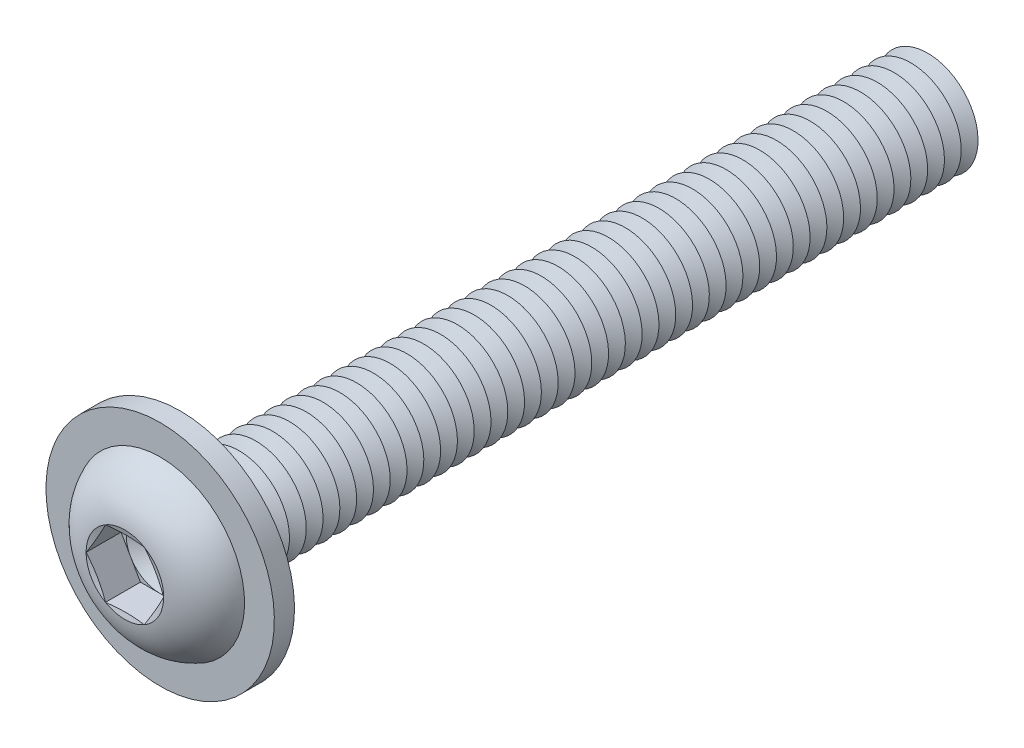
ISO-10303-21;
HEADER;
FILE_DESCRIPTION(('STEP AP214'),'2;1');
FILE_NAME('part.step','',(''),(''),'','','');
FILE_SCHEMA(('AUTOMOTIVE_DESIGN { 1 0 10303 214 1 1 1 1 }'));
ENDSEC;
DATA;
#1=APPLICATION_CONTEXT('core data for automotive mechanical design processes');
#2=APPLICATION_PROTOCOL_DEFINITION('international standard','automotive_design',2000,#1);
#3=PRODUCT_CONTEXT('',#1,'mechanical');
#4=PRODUCT('Part','Part','',(#3));
#5=PRODUCT_RELATED_PRODUCT_CATEGORY('part','',(#4));
#6=PRODUCT_DEFINITION_FORMATION('','',#4);
#7=PRODUCT_DEFINITION_CONTEXT('part definition',#1,'design');
#8=PRODUCT_DEFINITION('design','',#6,#7);
#9=PRODUCT_DEFINITION_SHAPE('','',#8);
#10=(LENGTH_UNIT() NAMED_UNIT(*) SI_UNIT(.MILLI.,.METRE.));
#11=(NAMED_UNIT(*) PLANE_ANGLE_UNIT() SI_UNIT($,.RADIAN.));
#12=(NAMED_UNIT(*) SI_UNIT($,.STERADIAN.) SOLID_ANGLE_UNIT());
#13=UNCERTAINTY_MEASURE_WITH_UNIT(LENGTH_MEASURE(1.E-05),#10,'distance_accuracy_value','');
#14=(GEOMETRIC_REPRESENTATION_CONTEXT(3) GLOBAL_UNCERTAINTY_ASSIGNED_CONTEXT((#13)) GLOBAL_UNIT_ASSIGNED_CONTEXT((#10,
#11,#12)) REPRESENTATION_CONTEXT('',''));
#15=CARTESIAN_POINT('',(0.,0.,0.));
#16=DIRECTION('',(0.,0.,1.));
#17=DIRECTION('',(1.,0.,0.));
#18=AXIS2_PLACEMENT_3D('',#15,#16,#17);
#19=CARTESIAN_POINT('',(0.,0.,-41.5));
#20=DIRECTION('',(0.,0.,1.));
#21=DIRECTION('',(0.,-1.,0.));
#22=AXIS2_PLACEMENT_3D('',#19,#20,#21);
#23=CONICAL_SURFACE('',#22,2.99999999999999,1.0471975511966);
#24=CARTESIAN_POINT('',(0.,0.,-42.));
#25=DIRECTION('',(0.,0.,1.));
#26=DIRECTION('',(0.,-1.,0.));
#27=AXIS2_PLACEMENT_3D('',#24,#25,#26);
#28=CIRCLE('',#27,2.13397459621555);
#29=CARTESIAN_POINT('',(0.,-2.13397459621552,-42.));
#30=VERTEX_POINT('',#29);
#31=EDGE_CURVE('E569',#30,#30,#28,.T.);
#32=ORIENTED_EDGE('',*,*,#31,.T.);
#33=EDGE_LOOP('',(#32));
#34=FACE_BOUND('',#33,.T.);
#35=CARTESIAN_POINT('',(0.,0.,-41.5));
#36=DIRECTION('',(0.,0.,1.));
#37=DIRECTION('',(0.,-1.,0.));
#38=AXIS2_PLACEMENT_3D('',#35,#36,#37);
#39=CIRCLE('',#38,2.99999999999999);
#40=CARTESIAN_POINT('',(0.,-2.99999999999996,-41.5));
#41=VERTEX_POINT('',#40);
#42=EDGE_CURVE('E565',#41,#41,#39,.T.);
#43=ORIENTED_EDGE('',*,*,#42,.F.);
#44=EDGE_LOOP('',(#43));
#45=FACE_BOUND('',#44,.T.);
#46=ADVANCED_FACE('F39',(#34,#45),#23,.T.);
#47=CARTESIAN_POINT('',(0.,0.,-42.));
#48=DIRECTION('',(0.,0.,-1.));
#49=DIRECTION('',(0.,1.,0.));
#50=AXIS2_PLACEMENT_3D('',#47,#48,#49);
#51=CONICAL_SURFACE('',#50,2.13397459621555,1.0471975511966);
#52=CARTESIAN_POINT('',(0.,0.,-42.5));
#53=DIRECTION('',(0.,0.,1.));
#54=DIRECTION('',(0.,-1.,0.));
#55=AXIS2_PLACEMENT_3D('',#52,#53,#54);
#56=CIRCLE('',#55,2.99999999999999);
#57=CARTESIAN_POINT('',(0.,-2.99999999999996,-42.5));
#58=VERTEX_POINT('',#57);
#59=EDGE_CURVE('E573',#58,#58,#56,.T.);
#60=ORIENTED_EDGE('',*,*,#59,.T.);
#61=EDGE_LOOP('',(#60));
#62=FACE_BOUND('',#61,.T.);
#63=ORIENTED_EDGE('',*,*,#31,.F.);
#64=EDGE_LOOP('',(#63));
#65=FACE_BOUND('',#64,.T.);
#66=ADVANCED_FACE('F688',(#62,#65),#51,.T.);
#67=CARTESIAN_POINT('',(0.,3.,-45.));
#68=DIRECTION('',(0.,0.,-1.));
#69=DIRECTION('',(0.,1.,0.));
#70=AXIS2_PLACEMENT_3D('',#67,#68,#69);
#71=PLANE('',#70);
#72=CARTESIAN_POINT('',(0.,0.,-45.));
#73=DIRECTION('',(0.,0.,1.));
#74=DIRECTION('',(0.,-1.,0.));
#75=AXIS2_PLACEMENT_3D('',#72,#73,#74);
#76=CIRCLE('',#75,2.13397459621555);
#77=CARTESIAN_POINT('',(0.,-2.13397459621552,-45.));
#78=VERTEX_POINT('',#77);
#79=EDGE_CURVE('E593',#78,#78,#76,.T.);
#80=ORIENTED_EDGE('',*,*,#79,.F.);
#81=EDGE_LOOP('',(#80));
#82=FACE_BOUND('',#81,.T.);
#83=ADVANCED_FACE('F694',(#82),#71,.T.);
#84=CARTESIAN_POINT('',(0.,0.,-44.5));
#85=DIRECTION('',(0.,0.,1.));
#86=DIRECTION('',(0.,-1.,0.));
#87=AXIS2_PLACEMENT_3D('',#84,#85,#86);
#88=CONICAL_SURFACE('',#87,2.99999999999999,1.0471975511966);
#89=ORIENTED_EDGE('',*,*,#79,.T.);
#90=EDGE_LOOP('',(#89));
#91=FACE_BOUND('',#90,.T.);
#92=CARTESIAN_POINT('',(0.,0.,-44.5));
#93=DIRECTION('',(0.,0.,1.));
#94=DIRECTION('',(0.,-1.,0.));
#95=AXIS2_PLACEMENT_3D('',#92,#93,#94);
#96=CIRCLE('',#95,2.99999999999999);
#97=CARTESIAN_POINT('',(0.,-2.99999999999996,-44.5));
#98=VERTEX_POINT('',#97);
#99=EDGE_CURVE('E589',#98,#98,#96,.T.);
#100=ORIENTED_EDGE('',*,*,#99,.F.);
#101=EDGE_LOOP('',(#100));
#102=FACE_BOUND('',#101,.T.);
#103=ADVANCED_FACE('F713',(#91,#102),#88,.T.);
#104=CARTESIAN_POINT('',(0.,0.,-44.));
#105=DIRECTION('',(0.,0.,-1.));
#106=DIRECTION('',(0.,1.,0.));
#107=AXIS2_PLACEMENT_3D('',#104,#105,#106);
#108=CONICAL_SURFACE('',#107,2.13397459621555,1.0471975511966);
#109=ORIENTED_EDGE('',*,*,#99,.T.);
#110=EDGE_LOOP('',(#109));
#111=FACE_BOUND('',#110,.T.);
#112=CARTESIAN_POINT('',(0.,0.,-44.));
#113=DIRECTION('',(0.,0.,1.));
#114=DIRECTION('',(0.,-1.,0.));
#115=AXIS2_PLACEMENT_3D('',#112,#113,#114);
#116=CIRCLE('',#115,2.13397459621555);
#117=CARTESIAN_POINT('',(0.,-2.13397459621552,-44.));
#118=VERTEX_POINT('',#117);
#119=EDGE_CURVE('E585',#118,#118,#116,.T.);
#120=ORIENTED_EDGE('',*,*,#119,.F.);
#121=EDGE_LOOP('',(#120));
#122=FACE_BOUND('',#121,.T.);
#123=ADVANCED_FACE('F710',(#111,#122),#108,.T.);
#124=CARTESIAN_POINT('',(0.,0.,-43.5));
#125=DIRECTION('',(0.,0.,1.));
#126=DIRECTION('',(0.,-1.,0.));
#127=AXIS2_PLACEMENT_3D('',#124,#125,#126);
#128=CONICAL_SURFACE('',#127,2.99999999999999,1.0471975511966);
#129=ORIENTED_EDGE('',*,*,#119,.T.);
#130=EDGE_LOOP('',(#129));
#131=FACE_BOUND('',#130,.T.);
#132=CARTESIAN_POINT('',(0.,0.,-43.5));
#133=DIRECTION('',(0.,0.,1.));
#134=DIRECTION('',(0.,-1.,0.));
#135=AXIS2_PLACEMENT_3D('',#132,#133,#134);
#136=CIRCLE('',#135,2.99999999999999);
#137=CARTESIAN_POINT('',(0.,-2.99999999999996,-43.5));
#138=VERTEX_POINT('',#137);
#139=EDGE_CURVE('E581',#138,#138,#136,.T.);
#140=ORIENTED_EDGE('',*,*,#139,.F.);
#141=EDGE_LOOP('',(#140));
#142=FACE_BOUND('',#141,.T.);
#143=ADVANCED_FACE('F704',(#131,#142),#128,.T.);
#144=CARTESIAN_POINT('',(0.,0.,-43.));
#145=DIRECTION('',(0.,0.,-1.));
#146=DIRECTION('',(0.,1.,0.));
#147=AXIS2_PLACEMENT_3D('',#144,#145,#146);
#148=CONICAL_SURFACE('',#147,2.13397459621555,1.0471975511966);
#149=ORIENTED_EDGE('',*,*,#139,.T.);
#150=EDGE_LOOP('',(#149));
#151=FACE_BOUND('',#150,.T.);
#152=CARTESIAN_POINT('',(0.,0.,-43.));
#153=DIRECTION('',(0.,0.,1.));
#154=DIRECTION('',(0.,-1.,0.));
#155=AXIS2_PLACEMENT_3D('',#152,#153,#154);
#156=CIRCLE('',#155,2.13397459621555);
#157=CARTESIAN_POINT('',(0.,-2.13397459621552,-43.));
#158=VERTEX_POINT('',#157);
#159=EDGE_CURVE('E577',#158,#158,#156,.T.);
#160=ORIENTED_EDGE('',*,*,#159,.F.);
#161=EDGE_LOOP('',(#160));
#162=FACE_BOUND('',#161,.T.);
#163=ADVANCED_FACE('F700',(#151,#162),#148,.T.);
#164=CARTESIAN_POINT('',(0.,0.,-42.5));
#165=DIRECTION('',(0.,0.,1.));
#166=DIRECTION('',(0.,-1.,0.));
#167=AXIS2_PLACEMENT_3D('',#164,#165,#166);
#168=CONICAL_SURFACE('',#167,2.99999999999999,1.0471975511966);
#169=ORIENTED_EDGE('',*,*,#159,.T.);
#170=EDGE_LOOP('',(#169));
#171=FACE_BOUND('',#170,.T.);
#172=ORIENTED_EDGE('',*,*,#59,.F.);
#173=EDGE_LOOP('',(#172));
#174=FACE_BOUND('',#173,.T.);
#175=ADVANCED_FACE('F703',(#171,#174),#168,.T.);
#176=CARTESIAN_POINT('',(0.,0.,-40.5));
#177=DIRECTION('',(0.,0.,1.));
#178=DIRECTION('',(0.,-1.,0.));
#179=AXIS2_PLACEMENT_3D('',#176,#177,#178);
#180=CONICAL_SURFACE('',#179,2.99999999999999,1.0471975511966);
#181=CARTESIAN_POINT('',(0.,0.,-41.));
#182=DIRECTION('',(0.,0.,1.));
#183=DIRECTION('',(0.,-1.,0.));
#184=AXIS2_PLACEMENT_3D('',#181,#182,#183);
#185=CIRCLE('',#184,2.13397459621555);
#186=CARTESIAN_POINT('',(0.,-2.13397459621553,-41.));
#187=VERTEX_POINT('',#186);
#188=EDGE_CURVE('E561',#187,#187,#185,.T.);
#189=ORIENTED_EDGE('',*,*,#188,.T.);
#190=EDGE_LOOP('',(#189));
#191=FACE_BOUND('',#190,.T.);
#192=CARTESIAN_POINT('',(0.,0.,-40.5));
#193=DIRECTION('',(0.,0.,1.));
#194=DIRECTION('',(0.,-1.,0.));
#195=AXIS2_PLACEMENT_3D('',#192,#193,#194);
#196=CIRCLE('',#195,2.99999999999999);
#197=CARTESIAN_POINT('',(0.,-2.99999999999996,-40.5));
#198=VERTEX_POINT('',#197);
#199=EDGE_CURVE('E557',#198,#198,#196,.T.);
#200=ORIENTED_EDGE('',*,*,#199,.F.);
#201=EDGE_LOOP('',(#200));
#202=FACE_BOUND('',#201,.T.);
#203=ADVANCED_FACE('F708',(#191,#202),#180,.T.);
#204=CARTESIAN_POINT('',(0.,0.,-41.));
#205=DIRECTION('',(0.,0.,-1.));
#206=DIRECTION('',(0.,1.,0.));
#207=AXIS2_PLACEMENT_3D('',#204,#205,#206);
#208=CONICAL_SURFACE('',#207,2.13397459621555,1.0471975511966);
#209=ORIENTED_EDGE('',*,*,#42,.T.);
#210=EDGE_LOOP('',(#209));
#211=FACE_BOUND('',#210,.T.);
#212=ORIENTED_EDGE('',*,*,#188,.F.);
#213=EDGE_LOOP('',(#212));
#214=FACE_BOUND('',#213,.T.);
#215=ADVANCED_FACE('F759',(#211,#214),#208,.T.);
#216=CARTESIAN_POINT('',(0.,0.,-39.5));
#217=DIRECTION('',(0.,0.,1.));
#218=DIRECTION('',(0.,-1.,0.));
#219=AXIS2_PLACEMENT_3D('',#216,#217,#218);
#220=CONICAL_SURFACE('',#219,2.99999999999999,1.0471975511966);
#221=CARTESIAN_POINT('',(0.,0.,-40.));
#222=DIRECTION('',(0.,0.,1.));
#223=DIRECTION('',(0.,-1.,0.));
#224=AXIS2_PLACEMENT_3D('',#221,#222,#223);
#225=CIRCLE('',#224,2.13397459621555);
#226=CARTESIAN_POINT('',(0.,-2.13397459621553,-40.));
#227=VERTEX_POINT('',#226);
#228=EDGE_CURVE('E553',#227,#227,#225,.T.);
#229=ORIENTED_EDGE('',*,*,#228,.T.);
#230=EDGE_LOOP('',(#229));
#231=FACE_BOUND('',#230,.T.);
#232=CARTESIAN_POINT('',(0.,0.,-39.5));
#233=DIRECTION('',(0.,0.,1.));
#234=DIRECTION('',(0.,-1.,0.));
#235=AXIS2_PLACEMENT_3D('',#232,#233,#234);
#236=CIRCLE('',#235,2.99999999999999);
#237=CARTESIAN_POINT('',(0.,-2.99999999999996,-39.5));
#238=VERTEX_POINT('',#237);
#239=EDGE_CURVE('E549',#238,#238,#236,.T.);
#240=ORIENTED_EDGE('',*,*,#239,.F.);
#241=EDGE_LOOP('',(#240));
#242=FACE_BOUND('',#241,.T.);
#243=ADVANCED_FACE('F765',(#231,#242),#220,.T.);
#244=CARTESIAN_POINT('',(0.,0.,-40.));
#245=DIRECTION('',(0.,0.,-1.));
#246=DIRECTION('',(0.,1.,0.));
#247=AXIS2_PLACEMENT_3D('',#244,#245,#246);
#248=CONICAL_SURFACE('',#247,2.13397459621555,1.0471975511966);
#249=ORIENTED_EDGE('',*,*,#199,.T.);
#250=EDGE_LOOP('',(#249));
#251=FACE_BOUND('',#250,.T.);
#252=ORIENTED_EDGE('',*,*,#228,.F.);
#253=EDGE_LOOP('',(#252));
#254=FACE_BOUND('',#253,.T.);
#255=ADVANCED_FACE('F772',(#251,#254),#248,.T.);
#256=CARTESIAN_POINT('',(0.,0.,-38.5));
#257=DIRECTION('',(0.,0.,1.));
#258=DIRECTION('',(0.,-1.,0.));
#259=AXIS2_PLACEMENT_3D('',#256,#257,#258);
#260=CONICAL_SURFACE('',#259,2.99999999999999,1.0471975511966);
#261=CARTESIAN_POINT('',(0.,0.,-39.));
#262=DIRECTION('',(0.,0.,1.));
#263=DIRECTION('',(0.,-1.,0.));
#264=AXIS2_PLACEMENT_3D('',#261,#262,#263);
#265=CIRCLE('',#264,2.13397459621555);
#266=CARTESIAN_POINT('',(0.,-2.13397459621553,-39.));
#267=VERTEX_POINT('',#266);
#268=EDGE_CURVE('E545',#267,#267,#265,.T.);
#269=ORIENTED_EDGE('',*,*,#268,.T.);
#270=EDGE_LOOP('',(#269));
#271=FACE_BOUND('',#270,.T.);
#272=CARTESIAN_POINT('',(0.,0.,-38.5));
#273=DIRECTION('',(0.,0.,1.));
#274=DIRECTION('',(0.,-1.,0.));
#275=AXIS2_PLACEMENT_3D('',#272,#273,#274);
#276=CIRCLE('',#275,2.99999999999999);
#277=CARTESIAN_POINT('',(0.,-2.99999999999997,-38.5));
#278=VERTEX_POINT('',#277);
#279=EDGE_CURVE('E541',#278,#278,#276,.T.);
#280=ORIENTED_EDGE('',*,*,#279,.F.);
#281=EDGE_LOOP('',(#280));
#282=FACE_BOUND('',#281,.T.);
#283=ADVANCED_FACE('F779',(#271,#282),#260,.T.);
#284=CARTESIAN_POINT('',(0.,0.,-39.));
#285=DIRECTION('',(0.,0.,-1.));
#286=DIRECTION('',(0.,1.,0.));
#287=AXIS2_PLACEMENT_3D('',#284,#285,#286);
#288=CONICAL_SURFACE('',#287,2.13397459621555,1.0471975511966);
#289=ORIENTED_EDGE('',*,*,#239,.T.);
#290=EDGE_LOOP('',(#289));
#291=FACE_BOUND('',#290,.T.);
#292=ORIENTED_EDGE('',*,*,#268,.F.);
#293=EDGE_LOOP('',(#292));
#294=FACE_BOUND('',#293,.T.);
#295=ADVANCED_FACE('F786',(#291,#294),#288,.T.);
#296=CARTESIAN_POINT('',(0.,0.,-37.5));
#297=DIRECTION('',(0.,0.,1.));
#298=DIRECTION('',(0.,-1.,0.));
#299=AXIS2_PLACEMENT_3D('',#296,#297,#298);
#300=CONICAL_SURFACE('',#299,2.99999999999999,1.0471975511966);
#301=CARTESIAN_POINT('',(0.,0.,-38.));
#302=DIRECTION('',(0.,0.,1.));
#303=DIRECTION('',(0.,-1.,0.));
#304=AXIS2_PLACEMENT_3D('',#301,#302,#303);
#305=CIRCLE('',#304,2.13397459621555);
#306=CARTESIAN_POINT('',(0.,-2.13397459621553,-38.));
#307=VERTEX_POINT('',#306);
#308=EDGE_CURVE('E537',#307,#307,#305,.T.);
#309=ORIENTED_EDGE('',*,*,#308,.T.);
#310=EDGE_LOOP('',(#309));
#311=FACE_BOUND('',#310,.T.);
#312=CARTESIAN_POINT('',(0.,0.,-37.5));
#313=DIRECTION('',(0.,0.,1.));
#314=DIRECTION('',(0.,-1.,0.));
#315=AXIS2_PLACEMENT_3D('',#312,#313,#314);
#316=CIRCLE('',#315,2.99999999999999);
#317=CARTESIAN_POINT('',(0.,-2.99999999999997,-37.5));
#318=VERTEX_POINT('',#317);
#319=EDGE_CURVE('E533',#318,#318,#316,.T.);
#320=ORIENTED_EDGE('',*,*,#319,.F.);
#321=EDGE_LOOP('',(#320));
#322=FACE_BOUND('',#321,.T.);
#323=ADVANCED_FACE('F793',(#311,#322),#300,.T.);
#324=CARTESIAN_POINT('',(0.,0.,-38.));
#325=DIRECTION('',(0.,0.,-1.));
#326=DIRECTION('',(0.,1.,0.));
#327=AXIS2_PLACEMENT_3D('',#324,#325,#326);
#328=CONICAL_SURFACE('',#327,2.13397459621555,1.0471975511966);
#329=ORIENTED_EDGE('',*,*,#279,.T.);
#330=EDGE_LOOP('',(#329));
#331=FACE_BOUND('',#330,.T.);
#332=ORIENTED_EDGE('',*,*,#308,.F.);
#333=EDGE_LOOP('',(#332));
#334=FACE_BOUND('',#333,.T.);
#335=ADVANCED_FACE('F800',(#331,#334),#328,.T.);
#336=CARTESIAN_POINT('',(0.,0.,-36.5));
#337=DIRECTION('',(0.,0.,1.));
#338=DIRECTION('',(0.,-1.,0.));
#339=AXIS2_PLACEMENT_3D('',#336,#337,#338);
#340=CONICAL_SURFACE('',#339,2.99999999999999,1.0471975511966);
#341=CARTESIAN_POINT('',(0.,0.,-37.));
#342=DIRECTION('',(0.,0.,1.));
#343=DIRECTION('',(0.,-1.,0.));
#344=AXIS2_PLACEMENT_3D('',#341,#342,#343);
#345=CIRCLE('',#344,2.13397459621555);
#346=CARTESIAN_POINT('',(0.,-2.13397459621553,-37.));
#347=VERTEX_POINT('',#346);
#348=EDGE_CURVE('E529',#347,#347,#345,.T.);
#349=ORIENTED_EDGE('',*,*,#348,.T.);
#350=EDGE_LOOP('',(#349));
#351=FACE_BOUND('',#350,.T.);
#352=CARTESIAN_POINT('',(0.,0.,-36.5));
#353=DIRECTION('',(0.,0.,1.));
#354=DIRECTION('',(0.,-1.,0.));
#355=AXIS2_PLACEMENT_3D('',#352,#353,#354);
#356=CIRCLE('',#355,2.99999999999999);
#357=CARTESIAN_POINT('',(0.,-2.99999999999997,-36.5));
#358=VERTEX_POINT('',#357);
#359=EDGE_CURVE('E525',#358,#358,#356,.T.);
#360=ORIENTED_EDGE('',*,*,#359,.F.);
#361=EDGE_LOOP('',(#360));
#362=FACE_BOUND('',#361,.T.);
#363=ADVANCED_FACE('F807',(#351,#362),#340,.T.);
#364=CARTESIAN_POINT('',(0.,0.,-37.));
#365=DIRECTION('',(0.,0.,-1.));
#366=DIRECTION('',(0.,1.,0.));
#367=AXIS2_PLACEMENT_3D('',#364,#365,#366);
#368=CONICAL_SURFACE('',#367,2.13397459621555,1.0471975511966);
#369=ORIENTED_EDGE('',*,*,#319,.T.);
#370=EDGE_LOOP('',(#369));
#371=FACE_BOUND('',#370,.T.);
#372=ORIENTED_EDGE('',*,*,#348,.F.);
#373=EDGE_LOOP('',(#372));
#374=FACE_BOUND('',#373,.T.);
#375=ADVANCED_FACE('F814',(#371,#374),#368,.T.);
#376=CARTESIAN_POINT('',(0.,0.,-35.5));
#377=DIRECTION('',(0.,0.,1.));
#378=DIRECTION('',(0.,-1.,0.));
#379=AXIS2_PLACEMENT_3D('',#376,#377,#378);
#380=CONICAL_SURFACE('',#379,2.99999999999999,1.0471975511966);
#381=CARTESIAN_POINT('',(0.,0.,-36.));
#382=DIRECTION('',(0.,0.,1.));
#383=DIRECTION('',(0.,-1.,0.));
#384=AXIS2_PLACEMENT_3D('',#381,#382,#383);
#385=CIRCLE('',#384,2.13397459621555);
#386=CARTESIAN_POINT('',(0.,-2.13397459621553,-36.));
#387=VERTEX_POINT('',#386);
#388=EDGE_CURVE('E521',#387,#387,#385,.T.);
#389=ORIENTED_EDGE('',*,*,#388,.T.);
#390=EDGE_LOOP('',(#389));
#391=FACE_BOUND('',#390,.T.);
#392=CARTESIAN_POINT('',(0.,0.,-35.5));
#393=DIRECTION('',(0.,0.,1.));
#394=DIRECTION('',(0.,-1.,0.));
#395=AXIS2_PLACEMENT_3D('',#392,#393,#394);
#396=CIRCLE('',#395,2.99999999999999);
#397=CARTESIAN_POINT('',(0.,-2.99999999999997,-35.5));
#398=VERTEX_POINT('',#397);
#399=EDGE_CURVE('E517',#398,#398,#396,.T.);
#400=ORIENTED_EDGE('',*,*,#399,.F.);
#401=EDGE_LOOP('',(#400));
#402=FACE_BOUND('',#401,.T.);
#403=ADVANCED_FACE('F821',(#391,#402),#380,.T.);
#404=CARTESIAN_POINT('',(0.,0.,-36.));
#405=DIRECTION('',(0.,0.,-1.));
#406=DIRECTION('',(0.,1.,0.));
#407=AXIS2_PLACEMENT_3D('',#404,#405,#406);
#408=CONICAL_SURFACE('',#407,2.13397459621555,1.0471975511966);
#409=ORIENTED_EDGE('',*,*,#359,.T.);
#410=EDGE_LOOP('',(#409));
#411=FACE_BOUND('',#410,.T.);
#412=ORIENTED_EDGE('',*,*,#388,.F.);
#413=EDGE_LOOP('',(#412));
#414=FACE_BOUND('',#413,.T.);
#415=ADVANCED_FACE('F828',(#411,#414),#408,.T.);
#416=CARTESIAN_POINT('',(0.,0.,-34.5));
#417=DIRECTION('',(0.,0.,1.));
#418=DIRECTION('',(0.,-1.,0.));
#419=AXIS2_PLACEMENT_3D('',#416,#417,#418);
#420=CONICAL_SURFACE('',#419,2.99999999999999,1.0471975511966);
#421=CARTESIAN_POINT('',(0.,0.,-35.));
#422=DIRECTION('',(0.,0.,1.));
#423=DIRECTION('',(0.,-1.,0.));
#424=AXIS2_PLACEMENT_3D('',#421,#422,#423);
#425=CIRCLE('',#424,2.13397459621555);
#426=CARTESIAN_POINT('',(0.,-2.13397459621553,-35.));
#427=VERTEX_POINT('',#426);
#428=EDGE_CURVE('E513',#427,#427,#425,.T.);
#429=ORIENTED_EDGE('',*,*,#428,.T.);
#430=EDGE_LOOP('',(#429));
#431=FACE_BOUND('',#430,.T.);
#432=CARTESIAN_POINT('',(0.,0.,-34.5));
#433=DIRECTION('',(0.,0.,1.));
#434=DIRECTION('',(0.,-1.,0.));
#435=AXIS2_PLACEMENT_3D('',#432,#433,#434);
#436=CIRCLE('',#435,2.99999999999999);
#437=CARTESIAN_POINT('',(0.,-2.99999999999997,-34.5));
#438=VERTEX_POINT('',#437);
#439=EDGE_CURVE('E509',#438,#438,#436,.T.);
#440=ORIENTED_EDGE('',*,*,#439,.F.);
#441=EDGE_LOOP('',(#440));
#442=FACE_BOUND('',#441,.T.);
#443=ADVANCED_FACE('F835',(#431,#442),#420,.T.);
#444=CARTESIAN_POINT('',(0.,0.,-35.));
#445=DIRECTION('',(0.,0.,-1.));
#446=DIRECTION('',(0.,1.,0.));
#447=AXIS2_PLACEMENT_3D('',#444,#445,#446);
#448=CONICAL_SURFACE('',#447,2.13397459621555,1.0471975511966);
#449=ORIENTED_EDGE('',*,*,#399,.T.);
#450=EDGE_LOOP('',(#449));
#451=FACE_BOUND('',#450,.T.);
#452=ORIENTED_EDGE('',*,*,#428,.F.);
#453=EDGE_LOOP('',(#452));
#454=FACE_BOUND('',#453,.T.);
#455=ADVANCED_FACE('F842',(#451,#454),#448,.T.);
#456=CARTESIAN_POINT('',(0.,0.,-33.5));
#457=DIRECTION('',(0.,0.,1.));
#458=DIRECTION('',(0.,-1.,0.));
#459=AXIS2_PLACEMENT_3D('',#456,#457,#458);
#460=CONICAL_SURFACE('',#459,2.99999999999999,1.0471975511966);
#461=CARTESIAN_POINT('',(0.,0.,-34.));
#462=DIRECTION('',(0.,0.,1.));
#463=DIRECTION('',(0.,-1.,0.));
#464=AXIS2_PLACEMENT_3D('',#461,#462,#463);
#465=CIRCLE('',#464,2.13397459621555);
#466=CARTESIAN_POINT('',(0.,-2.13397459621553,-34.));
#467=VERTEX_POINT('',#466);
#468=EDGE_CURVE('E505',#467,#467,#465,.T.);
#469=ORIENTED_EDGE('',*,*,#468,.T.);
#470=EDGE_LOOP('',(#469));
#471=FACE_BOUND('',#470,.T.);
#472=CARTESIAN_POINT('',(0.,0.,-33.5));
#473=DIRECTION('',(0.,0.,1.));
#474=DIRECTION('',(0.,-1.,0.));
#475=AXIS2_PLACEMENT_3D('',#472,#473,#474);
#476=CIRCLE('',#475,2.99999999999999);
#477=CARTESIAN_POINT('',(0.,-2.99999999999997,-33.5));
#478=VERTEX_POINT('',#477);
#479=EDGE_CURVE('E501',#478,#478,#476,.T.);
#480=ORIENTED_EDGE('',*,*,#479,.F.);
#481=EDGE_LOOP('',(#480));
#482=FACE_BOUND('',#481,.T.);
#483=ADVANCED_FACE('F849',(#471,#482),#460,.T.);
#484=CARTESIAN_POINT('',(0.,0.,-34.));
#485=DIRECTION('',(0.,0.,-1.));
#486=DIRECTION('',(0.,1.,0.));
#487=AXIS2_PLACEMENT_3D('',#484,#485,#486);
#488=CONICAL_SURFACE('',#487,2.13397459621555,1.0471975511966);
#489=ORIENTED_EDGE('',*,*,#439,.T.);
#490=EDGE_LOOP('',(#489));
#491=FACE_BOUND('',#490,.T.);
#492=ORIENTED_EDGE('',*,*,#468,.F.);
#493=EDGE_LOOP('',(#492));
#494=FACE_BOUND('',#493,.T.);
#495=ADVANCED_FACE('F856',(#491,#494),#488,.T.);
#496=CARTESIAN_POINT('',(0.,0.,-32.5));
#497=DIRECTION('',(0.,0.,1.));
#498=DIRECTION('',(0.,-1.,0.));
#499=AXIS2_PLACEMENT_3D('',#496,#497,#498);
#500=CONICAL_SURFACE('',#499,2.99999999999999,1.0471975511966);
#501=CARTESIAN_POINT('',(0.,0.,-33.));
#502=DIRECTION('',(0.,0.,1.));
#503=DIRECTION('',(0.,-1.,0.));
#504=AXIS2_PLACEMENT_3D('',#501,#502,#503);
#505=CIRCLE('',#504,2.13397459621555);
#506=CARTESIAN_POINT('',(0.,-2.13397459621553,-33.));
#507=VERTEX_POINT('',#506);
#508=EDGE_CURVE('E497',#507,#507,#505,.T.);
#509=ORIENTED_EDGE('',*,*,#508,.T.);
#510=EDGE_LOOP('',(#509));
#511=FACE_BOUND('',#510,.T.);
#512=CARTESIAN_POINT('',(0.,0.,-32.5));
#513=DIRECTION('',(0.,0.,1.));
#514=DIRECTION('',(0.,-1.,0.));
#515=AXIS2_PLACEMENT_3D('',#512,#513,#514);
#516=CIRCLE('',#515,2.99999999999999);
#517=CARTESIAN_POINT('',(0.,-2.99999999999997,-32.5));
#518=VERTEX_POINT('',#517);
#519=EDGE_CURVE('E493',#518,#518,#516,.T.);
#520=ORIENTED_EDGE('',*,*,#519,.F.);
#521=EDGE_LOOP('',(#520));
#522=FACE_BOUND('',#521,.T.);
#523=ADVANCED_FACE('F863',(#511,#522),#500,.T.);
#524=CARTESIAN_POINT('',(0.,0.,-33.));
#525=DIRECTION('',(0.,0.,-1.));
#526=DIRECTION('',(0.,1.,0.));
#527=AXIS2_PLACEMENT_3D('',#524,#525,#526);
#528=CONICAL_SURFACE('',#527,2.13397459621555,1.0471975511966);
#529=ORIENTED_EDGE('',*,*,#479,.T.);
#530=EDGE_LOOP('',(#529));
#531=FACE_BOUND('',#530,.T.);
#532=ORIENTED_EDGE('',*,*,#508,.F.);
#533=EDGE_LOOP('',(#532));
#534=FACE_BOUND('',#533,.T.);
#535=ADVANCED_FACE('F870',(#531,#534),#528,.T.);
#536=CARTESIAN_POINT('',(0.,0.,-31.5));
#537=DIRECTION('',(0.,0.,1.));
#538=DIRECTION('',(0.,-1.,0.));
#539=AXIS2_PLACEMENT_3D('',#536,#537,#538);
#540=CONICAL_SURFACE('',#539,2.99999999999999,1.0471975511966);
#541=CARTESIAN_POINT('',(0.,0.,-32.));
#542=DIRECTION('',(0.,0.,1.));
#543=DIRECTION('',(0.,-1.,0.));
#544=AXIS2_PLACEMENT_3D('',#541,#542,#543);
#545=CIRCLE('',#544,2.13397459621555);
#546=CARTESIAN_POINT('',(0.,-2.13397459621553,-32.));
#547=VERTEX_POINT('',#546);
#548=EDGE_CURVE('E489',#547,#547,#545,.T.);
#549=ORIENTED_EDGE('',*,*,#548,.T.);
#550=EDGE_LOOP('',(#549));
#551=FACE_BOUND('',#550,.T.);
#552=CARTESIAN_POINT('',(0.,0.,-31.5));
#553=DIRECTION('',(0.,0.,1.));
#554=DIRECTION('',(0.,-1.,0.));
#555=AXIS2_PLACEMENT_3D('',#552,#553,#554);
#556=CIRCLE('',#555,2.99999999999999);
#557=CARTESIAN_POINT('',(0.,-2.99999999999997,-31.5));
#558=VERTEX_POINT('',#557);
#559=EDGE_CURVE('E485',#558,#558,#556,.T.);
#560=ORIENTED_EDGE('',*,*,#559,.F.);
#561=EDGE_LOOP('',(#560));
#562=FACE_BOUND('',#561,.T.);
#563=ADVANCED_FACE('F877',(#551,#562),#540,.T.);
#564=CARTESIAN_POINT('',(0.,0.,-32.));
#565=DIRECTION('',(0.,0.,-1.));
#566=DIRECTION('',(0.,1.,0.));
#567=AXIS2_PLACEMENT_3D('',#564,#565,#566);
#568=CONICAL_SURFACE('',#567,2.13397459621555,1.0471975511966);
#569=ORIENTED_EDGE('',*,*,#519,.T.);
#570=EDGE_LOOP('',(#569));
#571=FACE_BOUND('',#570,.T.);
#572=ORIENTED_EDGE('',*,*,#548,.F.);
#573=EDGE_LOOP('',(#572));
#574=FACE_BOUND('',#573,.T.);
#575=ADVANCED_FACE('F884',(#571,#574),#568,.T.);
#576=CARTESIAN_POINT('',(0.,0.,-30.5));
#577=DIRECTION('',(0.,0.,1.));
#578=DIRECTION('',(0.,-1.,0.));
#579=AXIS2_PLACEMENT_3D('',#576,#577,#578);
#580=CONICAL_SURFACE('',#579,2.99999999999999,1.0471975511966);
#581=CARTESIAN_POINT('',(0.,0.,-31.));
#582=DIRECTION('',(0.,0.,1.));
#583=DIRECTION('',(0.,-1.,0.));
#584=AXIS2_PLACEMENT_3D('',#581,#582,#583);
#585=CIRCLE('',#584,2.13397459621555);
#586=CARTESIAN_POINT('',(0.,-2.13397459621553,-31.));
#587=VERTEX_POINT('',#586);
#588=EDGE_CURVE('E481',#587,#587,#585,.T.);
#589=ORIENTED_EDGE('',*,*,#588,.T.);
#590=EDGE_LOOP('',(#589));
#591=FACE_BOUND('',#590,.T.);
#592=CARTESIAN_POINT('',(0.,0.,-30.5));
#593=DIRECTION('',(0.,0.,1.));
#594=DIRECTION('',(0.,-1.,0.));
#595=AXIS2_PLACEMENT_3D('',#592,#593,#594);
#596=CIRCLE('',#595,2.99999999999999);
#597=CARTESIAN_POINT('',(0.,-2.99999999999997,-30.5));
#598=VERTEX_POINT('',#597);
#599=EDGE_CURVE('E477',#598,#598,#596,.T.);
#600=ORIENTED_EDGE('',*,*,#599,.F.);
#601=EDGE_LOOP('',(#600));
#602=FACE_BOUND('',#601,.T.);
#603=ADVANCED_FACE('F891',(#591,#602),#580,.T.);
#604=CARTESIAN_POINT('',(0.,0.,-31.));
#605=DIRECTION('',(0.,0.,-1.));
#606=DIRECTION('',(0.,1.,0.));
#607=AXIS2_PLACEMENT_3D('',#604,#605,#606);
#608=CONICAL_SURFACE('',#607,2.13397459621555,1.0471975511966);
#609=ORIENTED_EDGE('',*,*,#559,.T.);
#610=EDGE_LOOP('',(#609));
#611=FACE_BOUND('',#610,.T.);
#612=ORIENTED_EDGE('',*,*,#588,.F.);
#613=EDGE_LOOP('',(#612));
#614=FACE_BOUND('',#613,.T.);
#615=ADVANCED_FACE('F898',(#611,#614),#608,.T.);
#616=CARTESIAN_POINT('',(0.,0.,-29.5));
#617=DIRECTION('',(0.,0.,1.));
#618=DIRECTION('',(0.,-1.,0.));
#619=AXIS2_PLACEMENT_3D('',#616,#617,#618);
#620=CONICAL_SURFACE('',#619,2.99999999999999,1.0471975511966);
#621=CARTESIAN_POINT('',(0.,0.,-30.));
#622=DIRECTION('',(0.,0.,1.));
#623=DIRECTION('',(0.,-1.,0.));
#624=AXIS2_PLACEMENT_3D('',#621,#622,#623);
#625=CIRCLE('',#624,2.13397459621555);
#626=CARTESIAN_POINT('',(0.,-2.13397459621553,-30.));
#627=VERTEX_POINT('',#626);
#628=EDGE_CURVE('E473',#627,#627,#625,.T.);
#629=ORIENTED_EDGE('',*,*,#628,.T.);
#630=EDGE_LOOP('',(#629));
#631=FACE_BOUND('',#630,.T.);
#632=CARTESIAN_POINT('',(0.,0.,-29.5));
#633=DIRECTION('',(0.,0.,1.));
#634=DIRECTION('',(0.,-1.,0.));
#635=AXIS2_PLACEMENT_3D('',#632,#633,#634);
#636=CIRCLE('',#635,2.99999999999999);
#637=CARTESIAN_POINT('',(0.,-2.99999999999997,-29.5));
#638=VERTEX_POINT('',#637);
#639=EDGE_CURVE('E469',#638,#638,#636,.T.);
#640=ORIENTED_EDGE('',*,*,#639,.F.);
#641=EDGE_LOOP('',(#640));
#642=FACE_BOUND('',#641,.T.);
#643=ADVANCED_FACE('F905',(#631,#642),#620,.T.);
#644=CARTESIAN_POINT('',(0.,0.,-30.));
#645=DIRECTION('',(0.,0.,-1.));
#646=DIRECTION('',(0.,1.,0.));
#647=AXIS2_PLACEMENT_3D('',#644,#645,#646);
#648=CONICAL_SURFACE('',#647,2.13397459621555,1.0471975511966);
#649=ORIENTED_EDGE('',*,*,#599,.T.);
#650=EDGE_LOOP('',(#649));
#651=FACE_BOUND('',#650,.T.);
#652=ORIENTED_EDGE('',*,*,#628,.F.);
#653=EDGE_LOOP('',(#652));
#654=FACE_BOUND('',#653,.T.);
#655=ADVANCED_FACE('F912',(#651,#654),#648,.T.);
#656=CARTESIAN_POINT('',(0.,0.,-28.5));
#657=DIRECTION('',(0.,0.,1.));
#658=DIRECTION('',(0.,-1.,0.));
#659=AXIS2_PLACEMENT_3D('',#656,#657,#658);
#660=CONICAL_SURFACE('',#659,2.99999999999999,1.0471975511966);
#661=CARTESIAN_POINT('',(0.,0.,-29.));
#662=DIRECTION('',(0.,0.,1.));
#663=DIRECTION('',(0.,-1.,0.));
#664=AXIS2_PLACEMENT_3D('',#661,#662,#663);
#665=CIRCLE('',#664,2.13397459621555);
#666=CARTESIAN_POINT('',(0.,-2.13397459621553,-29.));
#667=VERTEX_POINT('',#666);
#668=EDGE_CURVE('E465',#667,#667,#665,.T.);
#669=ORIENTED_EDGE('',*,*,#668,.T.);
#670=EDGE_LOOP('',(#669));
#671=FACE_BOUND('',#670,.T.);
#672=CARTESIAN_POINT('',(0.,0.,-28.5));
#673=DIRECTION('',(0.,0.,1.));
#674=DIRECTION('',(0.,-1.,0.));
#675=AXIS2_PLACEMENT_3D('',#672,#673,#674);
#676=CIRCLE('',#675,2.99999999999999);
#677=CARTESIAN_POINT('',(0.,-2.99999999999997,-28.5));
#678=VERTEX_POINT('',#677);
#679=EDGE_CURVE('E461',#678,#678,#676,.T.);
#680=ORIENTED_EDGE('',*,*,#679,.F.);
#681=EDGE_LOOP('',(#680));
#682=FACE_BOUND('',#681,.T.);
#683=ADVANCED_FACE('F919',(#671,#682),#660,.T.);
#684=CARTESIAN_POINT('',(0.,0.,-29.));
#685=DIRECTION('',(0.,0.,-1.));
#686=DIRECTION('',(0.,1.,0.));
#687=AXIS2_PLACEMENT_3D('',#684,#685,#686);
#688=CONICAL_SURFACE('',#687,2.13397459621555,1.0471975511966);
#689=ORIENTED_EDGE('',*,*,#639,.T.);
#690=EDGE_LOOP('',(#689));
#691=FACE_BOUND('',#690,.T.);
#692=ORIENTED_EDGE('',*,*,#668,.F.);
#693=EDGE_LOOP('',(#692));
#694=FACE_BOUND('',#693,.T.);
#695=ADVANCED_FACE('F926',(#691,#694),#688,.T.);
#696=CARTESIAN_POINT('',(0.,0.,-27.5));
#697=DIRECTION('',(0.,0.,1.));
#698=DIRECTION('',(0.,-1.,0.));
#699=AXIS2_PLACEMENT_3D('',#696,#697,#698);
#700=CONICAL_SURFACE('',#699,2.99999999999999,1.0471975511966);
#701=CARTESIAN_POINT('',(0.,0.,-28.));
#702=DIRECTION('',(0.,0.,1.));
#703=DIRECTION('',(0.,-1.,0.));
#704=AXIS2_PLACEMENT_3D('',#701,#702,#703);
#705=CIRCLE('',#704,2.13397459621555);
#706=CARTESIAN_POINT('',(0.,-2.13397459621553,-28.));
#707=VERTEX_POINT('',#706);
#708=EDGE_CURVE('E457',#707,#707,#705,.T.);
#709=ORIENTED_EDGE('',*,*,#708,.T.);
#710=EDGE_LOOP('',(#709));
#711=FACE_BOUND('',#710,.T.);
#712=CARTESIAN_POINT('',(0.,0.,-27.5));
#713=DIRECTION('',(0.,0.,1.));
#714=DIRECTION('',(0.,-1.,0.));
#715=AXIS2_PLACEMENT_3D('',#712,#713,#714);
#716=CIRCLE('',#715,2.99999999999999);
#717=CARTESIAN_POINT('',(0.,-2.99999999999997,-27.5));
#718=VERTEX_POINT('',#717);
#719=EDGE_CURVE('E453',#718,#718,#716,.T.);
#720=ORIENTED_EDGE('',*,*,#719,.F.);
#721=EDGE_LOOP('',(#720));
#722=FACE_BOUND('',#721,.T.);
#723=ADVANCED_FACE('F933',(#711,#722),#700,.T.);
#724=CARTESIAN_POINT('',(0.,0.,-28.));
#725=DIRECTION('',(0.,0.,-1.));
#726=DIRECTION('',(0.,1.,0.));
#727=AXIS2_PLACEMENT_3D('',#724,#725,#726);
#728=CONICAL_SURFACE('',#727,2.13397459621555,1.0471975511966);
#729=ORIENTED_EDGE('',*,*,#679,.T.);
#730=EDGE_LOOP('',(#729));
#731=FACE_BOUND('',#730,.T.);
#732=ORIENTED_EDGE('',*,*,#708,.F.);
#733=EDGE_LOOP('',(#732));
#734=FACE_BOUND('',#733,.T.);
#735=ADVANCED_FACE('F940',(#731,#734),#728,.T.);
#736=CARTESIAN_POINT('',(0.,0.,-26.5));
#737=DIRECTION('',(0.,0.,1.));
#738=DIRECTION('',(0.,-1.,0.));
#739=AXIS2_PLACEMENT_3D('',#736,#737,#738);
#740=CONICAL_SURFACE('',#739,2.99999999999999,1.0471975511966);
#741=CARTESIAN_POINT('',(0.,0.,-27.));
#742=DIRECTION('',(0.,0.,1.));
#743=DIRECTION('',(0.,-1.,0.));
#744=AXIS2_PLACEMENT_3D('',#741,#742,#743);
#745=CIRCLE('',#744,2.13397459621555);
#746=CARTESIAN_POINT('',(0.,-2.13397459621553,-27.));
#747=VERTEX_POINT('',#746);
#748=EDGE_CURVE('E449',#747,#747,#745,.T.);
#749=ORIENTED_EDGE('',*,*,#748,.T.);
#750=EDGE_LOOP('',(#749));
#751=FACE_BOUND('',#750,.T.);
#752=CARTESIAN_POINT('',(0.,0.,-26.5));
#753=DIRECTION('',(0.,0.,1.));
#754=DIRECTION('',(0.,-1.,0.));
#755=AXIS2_PLACEMENT_3D('',#752,#753,#754);
#756=CIRCLE('',#755,2.99999999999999);
#757=CARTESIAN_POINT('',(0.,-2.99999999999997,-26.5));
#758=VERTEX_POINT('',#757);
#759=EDGE_CURVE('E445',#758,#758,#756,.T.);
#760=ORIENTED_EDGE('',*,*,#759,.F.);
#761=EDGE_LOOP('',(#760));
#762=FACE_BOUND('',#761,.T.);
#763=ADVANCED_FACE('F947',(#751,#762),#740,.T.);
#764=CARTESIAN_POINT('',(0.,0.,-27.));
#765=DIRECTION('',(0.,0.,-1.));
#766=DIRECTION('',(0.,1.,0.));
#767=AXIS2_PLACEMENT_3D('',#764,#765,#766);
#768=CONICAL_SURFACE('',#767,2.13397459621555,1.0471975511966);
#769=ORIENTED_EDGE('',*,*,#719,.T.);
#770=EDGE_LOOP('',(#769));
#771=FACE_BOUND('',#770,.T.);
#772=ORIENTED_EDGE('',*,*,#748,.F.);
#773=EDGE_LOOP('',(#772));
#774=FACE_BOUND('',#773,.T.);
#775=ADVANCED_FACE('F954',(#771,#774),#768,.T.);
#776=CARTESIAN_POINT('',(0.,0.,-25.5));
#777=DIRECTION('',(0.,0.,1.));
#778=DIRECTION('',(0.,-1.,0.));
#779=AXIS2_PLACEMENT_3D('',#776,#777,#778);
#780=CONICAL_SURFACE('',#779,2.99999999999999,1.0471975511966);
#781=CARTESIAN_POINT('',(0.,0.,-26.));
#782=DIRECTION('',(0.,0.,1.));
#783=DIRECTION('',(0.,-1.,0.));
#784=AXIS2_PLACEMENT_3D('',#781,#782,#783);
#785=CIRCLE('',#784,2.13397459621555);
#786=CARTESIAN_POINT('',(0.,-2.13397459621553,-26.));
#787=VERTEX_POINT('',#786);
#788=EDGE_CURVE('E441',#787,#787,#785,.T.);
#789=ORIENTED_EDGE('',*,*,#788,.T.);
#790=EDGE_LOOP('',(#789));
#791=FACE_BOUND('',#790,.T.);
#792=CARTESIAN_POINT('',(0.,0.,-25.5));
#793=DIRECTION('',(0.,0.,1.));
#794=DIRECTION('',(0.,-1.,0.));
#795=AXIS2_PLACEMENT_3D('',#792,#793,#794);
#796=CIRCLE('',#795,2.99999999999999);
#797=CARTESIAN_POINT('',(0.,-2.99999999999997,-25.5));
#798=VERTEX_POINT('',#797);
#799=EDGE_CURVE('E437',#798,#798,#796,.T.);
#800=ORIENTED_EDGE('',*,*,#799,.F.);
#801=EDGE_LOOP('',(#800));
#802=FACE_BOUND('',#801,.T.);
#803=ADVANCED_FACE('F961',(#791,#802),#780,.T.);
#804=CARTESIAN_POINT('',(0.,0.,-26.));
#805=DIRECTION('',(0.,0.,-1.));
#806=DIRECTION('',(0.,1.,0.));
#807=AXIS2_PLACEMENT_3D('',#804,#805,#806);
#808=CONICAL_SURFACE('',#807,2.13397459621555,1.0471975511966);
#809=ORIENTED_EDGE('',*,*,#759,.T.);
#810=EDGE_LOOP('',(#809));
#811=FACE_BOUND('',#810,.T.);
#812=ORIENTED_EDGE('',*,*,#788,.F.);
#813=EDGE_LOOP('',(#812));
#814=FACE_BOUND('',#813,.T.);
#815=ADVANCED_FACE('F968',(#811,#814),#808,.T.);
#816=CARTESIAN_POINT('',(0.,0.,-24.5));
#817=DIRECTION('',(0.,0.,1.));
#818=DIRECTION('',(0.,-1.,0.));
#819=AXIS2_PLACEMENT_3D('',#816,#817,#818);
#820=CONICAL_SURFACE('',#819,2.99999999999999,1.0471975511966);
#821=CARTESIAN_POINT('',(0.,0.,-25.));
#822=DIRECTION('',(0.,0.,1.));
#823=DIRECTION('',(0.,-1.,0.));
#824=AXIS2_PLACEMENT_3D('',#821,#822,#823);
#825=CIRCLE('',#824,2.13397459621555);
#826=CARTESIAN_POINT('',(0.,-2.13397459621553,-25.));
#827=VERTEX_POINT('',#826);
#828=EDGE_CURVE('E433',#827,#827,#825,.T.);
#829=ORIENTED_EDGE('',*,*,#828,.T.);
#830=EDGE_LOOP('',(#829));
#831=FACE_BOUND('',#830,.T.);
#832=CARTESIAN_POINT('',(0.,0.,-24.5));
#833=DIRECTION('',(0.,0.,1.));
#834=DIRECTION('',(0.,-1.,0.));
#835=AXIS2_PLACEMENT_3D('',#832,#833,#834);
#836=CIRCLE('',#835,2.99999999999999);
#837=CARTESIAN_POINT('',(0.,-2.99999999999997,-24.5));
#838=VERTEX_POINT('',#837);
#839=EDGE_CURVE('E429',#838,#838,#836,.T.);
#840=ORIENTED_EDGE('',*,*,#839,.F.);
#841=EDGE_LOOP('',(#840));
#842=FACE_BOUND('',#841,.T.);
#843=ADVANCED_FACE('F975',(#831,#842),#820,.T.);
#844=CARTESIAN_POINT('',(0.,0.,-25.));
#845=DIRECTION('',(0.,0.,-1.));
#846=DIRECTION('',(0.,1.,0.));
#847=AXIS2_PLACEMENT_3D('',#844,#845,#846);
#848=CONICAL_SURFACE('',#847,2.13397459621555,1.0471975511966);
#849=ORIENTED_EDGE('',*,*,#799,.T.);
#850=EDGE_LOOP('',(#849));
#851=FACE_BOUND('',#850,.T.);
#852=ORIENTED_EDGE('',*,*,#828,.F.);
#853=EDGE_LOOP('',(#852));
#854=FACE_BOUND('',#853,.T.);
#855=ADVANCED_FACE('F982',(#851,#854),#848,.T.);
#856=CARTESIAN_POINT('',(0.,0.,-23.5));
#857=DIRECTION('',(0.,0.,1.));
#858=DIRECTION('',(0.,-1.,0.));
#859=AXIS2_PLACEMENT_3D('',#856,#857,#858);
#860=CONICAL_SURFACE('',#859,2.99999999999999,1.0471975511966);
#861=CARTESIAN_POINT('',(0.,0.,-24.));
#862=DIRECTION('',(0.,0.,1.));
#863=DIRECTION('',(0.,-1.,0.));
#864=AXIS2_PLACEMENT_3D('',#861,#862,#863);
#865=CIRCLE('',#864,2.13397459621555);
#866=CARTESIAN_POINT('',(0.,-2.13397459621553,-24.));
#867=VERTEX_POINT('',#866);
#868=EDGE_CURVE('E425',#867,#867,#865,.T.);
#869=ORIENTED_EDGE('',*,*,#868,.T.);
#870=EDGE_LOOP('',(#869));
#871=FACE_BOUND('',#870,.T.);
#872=CARTESIAN_POINT('',(0.,0.,-23.5));
#873=DIRECTION('',(0.,0.,1.));
#874=DIRECTION('',(0.,-1.,0.));
#875=AXIS2_PLACEMENT_3D('',#872,#873,#874);
#876=CIRCLE('',#875,2.99999999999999);
#877=CARTESIAN_POINT('',(0.,-2.99999999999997,-23.5));
#878=VERTEX_POINT('',#877);
#879=EDGE_CURVE('E421',#878,#878,#876,.T.);
#880=ORIENTED_EDGE('',*,*,#879,.F.);
#881=EDGE_LOOP('',(#880));
#882=FACE_BOUND('',#881,.T.);
#883=ADVANCED_FACE('F989',(#871,#882),#860,.T.);
#884=CARTESIAN_POINT('',(0.,0.,-24.));
#885=DIRECTION('',(0.,0.,-1.));
#886=DIRECTION('',(0.,1.,0.));
#887=AXIS2_PLACEMENT_3D('',#884,#885,#886);
#888=CONICAL_SURFACE('',#887,2.13397459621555,1.0471975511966);
#889=ORIENTED_EDGE('',*,*,#839,.T.);
#890=EDGE_LOOP('',(#889));
#891=FACE_BOUND('',#890,.T.);
#892=ORIENTED_EDGE('',*,*,#868,.F.);
#893=EDGE_LOOP('',(#892));
#894=FACE_BOUND('',#893,.T.);
#895=ADVANCED_FACE('F996',(#891,#894),#888,.T.);
#896=CARTESIAN_POINT('',(0.,0.,-22.5));
#897=DIRECTION('',(0.,0.,1.));
#898=DIRECTION('',(0.,-1.,0.));
#899=AXIS2_PLACEMENT_3D('',#896,#897,#898);
#900=CONICAL_SURFACE('',#899,2.99999999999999,1.0471975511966);
#901=CARTESIAN_POINT('',(0.,0.,-23.));
#902=DIRECTION('',(0.,0.,1.));
#903=DIRECTION('',(0.,-1.,0.));
#904=AXIS2_PLACEMENT_3D('',#901,#902,#903);
#905=CIRCLE('',#904,2.13397459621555);
#906=CARTESIAN_POINT('',(0.,-2.13397459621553,-23.));
#907=VERTEX_POINT('',#906);
#908=EDGE_CURVE('E417',#907,#907,#905,.T.);
#909=ORIENTED_EDGE('',*,*,#908,.T.);
#910=EDGE_LOOP('',(#909));
#911=FACE_BOUND('',#910,.T.);
#912=CARTESIAN_POINT('',(0.,0.,-22.5));
#913=DIRECTION('',(0.,0.,1.));
#914=DIRECTION('',(0.,-1.,0.));
#915=AXIS2_PLACEMENT_3D('',#912,#913,#914);
#916=CIRCLE('',#915,2.99999999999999);
#917=CARTESIAN_POINT('',(0.,-2.99999999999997,-22.5));
#918=VERTEX_POINT('',#917);
#919=EDGE_CURVE('E413',#918,#918,#916,.T.);
#920=ORIENTED_EDGE('',*,*,#919,.F.);
#921=EDGE_LOOP('',(#920));
#922=FACE_BOUND('',#921,.T.);
#923=ADVANCED_FACE('F1003',(#911,#922),#900,.T.);
#924=CARTESIAN_POINT('',(0.,0.,-23.));
#925=DIRECTION('',(0.,0.,-1.));
#926=DIRECTION('',(0.,1.,0.));
#927=AXIS2_PLACEMENT_3D('',#924,#925,#926);
#928=CONICAL_SURFACE('',#927,2.13397459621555,1.0471975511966);
#929=ORIENTED_EDGE('',*,*,#879,.T.);
#930=EDGE_LOOP('',(#929));
#931=FACE_BOUND('',#930,.T.);
#932=ORIENTED_EDGE('',*,*,#908,.F.);
#933=EDGE_LOOP('',(#932));
#934=FACE_BOUND('',#933,.T.);
#935=ADVANCED_FACE('F1010',(#931,#934),#928,.T.);
#936=CARTESIAN_POINT('',(0.,0.,-21.5));
#937=DIRECTION('',(0.,0.,1.));
#938=DIRECTION('',(0.,-1.,0.));
#939=AXIS2_PLACEMENT_3D('',#936,#937,#938);
#940=CONICAL_SURFACE('',#939,2.99999999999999,1.0471975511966);
#941=CARTESIAN_POINT('',(0.,0.,-22.));
#942=DIRECTION('',(0.,0.,1.));
#943=DIRECTION('',(0.,-1.,0.));
#944=AXIS2_PLACEMENT_3D('',#941,#942,#943);
#945=CIRCLE('',#944,2.13397459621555);
#946=CARTESIAN_POINT('',(0.,-2.13397459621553,-22.));
#947=VERTEX_POINT('',#946);
#948=EDGE_CURVE('E409',#947,#947,#945,.T.);
#949=ORIENTED_EDGE('',*,*,#948,.T.);
#950=EDGE_LOOP('',(#949));
#951=FACE_BOUND('',#950,.T.);
#952=CARTESIAN_POINT('',(0.,0.,-21.5));
#953=DIRECTION('',(0.,0.,1.));
#954=DIRECTION('',(0.,-1.,0.));
#955=AXIS2_PLACEMENT_3D('',#952,#953,#954);
#956=CIRCLE('',#955,2.99999999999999);
#957=CARTESIAN_POINT('',(0.,-2.99999999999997,-21.5));
#958=VERTEX_POINT('',#957);
#959=EDGE_CURVE('E405',#958,#958,#956,.T.);
#960=ORIENTED_EDGE('',*,*,#959,.F.);
#961=EDGE_LOOP('',(#960));
#962=FACE_BOUND('',#961,.T.);
#963=ADVANCED_FACE('F1017',(#951,#962),#940,.T.);
#964=CARTESIAN_POINT('',(0.,0.,-22.));
#965=DIRECTION('',(0.,0.,-1.));
#966=DIRECTION('',(0.,1.,0.));
#967=AXIS2_PLACEMENT_3D('',#964,#965,#966);
#968=CONICAL_SURFACE('',#967,2.13397459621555,1.0471975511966);
#969=ORIENTED_EDGE('',*,*,#919,.T.);
#970=EDGE_LOOP('',(#969));
#971=FACE_BOUND('',#970,.T.);
#972=ORIENTED_EDGE('',*,*,#948,.F.);
#973=EDGE_LOOP('',(#972));
#974=FACE_BOUND('',#973,.T.);
#975=ADVANCED_FACE('F1024',(#971,#974),#968,.T.);
#976=CARTESIAN_POINT('',(0.,0.,-20.5));
#977=DIRECTION('',(0.,0.,1.));
#978=DIRECTION('',(0.,-1.,0.));
#979=AXIS2_PLACEMENT_3D('',#976,#977,#978);
#980=CONICAL_SURFACE('',#979,2.99999999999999,1.0471975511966);
#981=CARTESIAN_POINT('',(0.,0.,-21.));
#982=DIRECTION('',(0.,0.,1.));
#983=DIRECTION('',(0.,-1.,0.));
#984=AXIS2_PLACEMENT_3D('',#981,#982,#983);
#985=CIRCLE('',#984,2.13397459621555);
#986=CARTESIAN_POINT('',(0.,-2.13397459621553,-21.));
#987=VERTEX_POINT('',#986);
#988=EDGE_CURVE('E401',#987,#987,#985,.T.);
#989=ORIENTED_EDGE('',*,*,#988,.T.);
#990=EDGE_LOOP('',(#989));
#991=FACE_BOUND('',#990,.T.);
#992=CARTESIAN_POINT('',(0.,0.,-20.5));
#993=DIRECTION('',(0.,0.,1.));
#994=DIRECTION('',(0.,-1.,0.));
#995=AXIS2_PLACEMENT_3D('',#992,#993,#994);
#996=CIRCLE('',#995,2.99999999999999);
#997=CARTESIAN_POINT('',(0.,-2.99999999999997,-20.5));
#998=VERTEX_POINT('',#997);
#999=EDGE_CURVE('E397',#998,#998,#996,.T.);
#1000=ORIENTED_EDGE('',*,*,#999,.F.);
#1001=EDGE_LOOP('',(#1000));
#1002=FACE_BOUND('',#1001,.T.);
#1003=ADVANCED_FACE('F1031',(#991,#1002),#980,.T.);
#1004=CARTESIAN_POINT('',(0.,0.,-21.));
#1005=DIRECTION('',(0.,0.,-1.));
#1006=DIRECTION('',(0.,1.,0.));
#1007=AXIS2_PLACEMENT_3D('',#1004,#1005,#1006);
#1008=CONICAL_SURFACE('',#1007,2.13397459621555,1.0471975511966);
#1009=ORIENTED_EDGE('',*,*,#959,.T.);
#1010=EDGE_LOOP('',(#1009));
#1011=FACE_BOUND('',#1010,.T.);
#1012=ORIENTED_EDGE('',*,*,#988,.F.);
#1013=EDGE_LOOP('',(#1012));
#1014=FACE_BOUND('',#1013,.T.);
#1015=ADVANCED_FACE('F1038',(#1011,#1014),#1008,.T.);
#1016=CARTESIAN_POINT('',(0.,0.,-19.5));
#1017=DIRECTION('',(0.,0.,1.));
#1018=DIRECTION('',(0.,-1.,0.));
#1019=AXIS2_PLACEMENT_3D('',#1016,#1017,#1018);
#1020=CONICAL_SURFACE('',#1019,2.99999999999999,1.0471975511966);
#1021=CARTESIAN_POINT('',(0.,0.,-20.));
#1022=DIRECTION('',(0.,0.,1.));
#1023=DIRECTION('',(0.,-1.,0.));
#1024=AXIS2_PLACEMENT_3D('',#1021,#1022,#1023);
#1025=CIRCLE('',#1024,2.13397459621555);
#1026=CARTESIAN_POINT('',(0.,-2.13397459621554,-20.));
#1027=VERTEX_POINT('',#1026);
#1028=EDGE_CURVE('E393',#1027,#1027,#1025,.T.);
#1029=ORIENTED_EDGE('',*,*,#1028,.T.);
#1030=EDGE_LOOP('',(#1029));
#1031=FACE_BOUND('',#1030,.T.);
#1032=CARTESIAN_POINT('',(0.,0.,-19.5));
#1033=DIRECTION('',(0.,0.,1.));
#1034=DIRECTION('',(0.,-1.,0.));
#1035=AXIS2_PLACEMENT_3D('',#1032,#1033,#1034);
#1036=CIRCLE('',#1035,2.99999999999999);
#1037=CARTESIAN_POINT('',(0.,-2.99999999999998,-19.5));
#1038=VERTEX_POINT('',#1037);
#1039=EDGE_CURVE('E389',#1038,#1038,#1036,.T.);
#1040=ORIENTED_EDGE('',*,*,#1039,.F.);
#1041=EDGE_LOOP('',(#1040));
#1042=FACE_BOUND('',#1041,.T.);
#1043=ADVANCED_FACE('F1045',(#1031,#1042),#1020,.T.);
#1044=CARTESIAN_POINT('',(0.,0.,-20.));
#1045=DIRECTION('',(0.,0.,-1.));
#1046=DIRECTION('',(0.,1.,0.));
#1047=AXIS2_PLACEMENT_3D('',#1044,#1045,#1046);
#1048=CONICAL_SURFACE('',#1047,2.13397459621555,1.0471975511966);
#1049=ORIENTED_EDGE('',*,*,#999,.T.);
#1050=EDGE_LOOP('',(#1049));
#1051=FACE_BOUND('',#1050,.T.);
#1052=ORIENTED_EDGE('',*,*,#1028,.F.);
#1053=EDGE_LOOP('',(#1052));
#1054=FACE_BOUND('',#1053,.T.);
#1055=ADVANCED_FACE('F1052',(#1051,#1054),#1048,.T.);
#1056=CARTESIAN_POINT('',(0.,0.,-18.5));
#1057=DIRECTION('',(0.,0.,1.));
#1058=DIRECTION('',(0.,-1.,0.));
#1059=AXIS2_PLACEMENT_3D('',#1056,#1057,#1058);
#1060=CONICAL_SURFACE('',#1059,2.99999999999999,1.0471975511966);
#1061=CARTESIAN_POINT('',(0.,0.,-19.));
#1062=DIRECTION('',(0.,0.,1.));
#1063=DIRECTION('',(0.,-1.,0.));
#1064=AXIS2_PLACEMENT_3D('',#1061,#1062,#1063);
#1065=CIRCLE('',#1064,2.13397459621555);
#1066=CARTESIAN_POINT('',(0.,-2.13397459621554,-19.));
#1067=VERTEX_POINT('',#1066);
#1068=EDGE_CURVE('E385',#1067,#1067,#1065,.T.);
#1069=ORIENTED_EDGE('',*,*,#1068,.T.);
#1070=EDGE_LOOP('',(#1069));
#1071=FACE_BOUND('',#1070,.T.);
#1072=CARTESIAN_POINT('',(0.,0.,-18.5));
#1073=DIRECTION('',(0.,0.,1.));
#1074=DIRECTION('',(0.,-1.,0.));
#1075=AXIS2_PLACEMENT_3D('',#1072,#1073,#1074);
#1076=CIRCLE('',#1075,2.99999999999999);
#1077=CARTESIAN_POINT('',(0.,-2.99999999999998,-18.5));
#1078=VERTEX_POINT('',#1077);
#1079=EDGE_CURVE('E381',#1078,#1078,#1076,.T.);
#1080=ORIENTED_EDGE('',*,*,#1079,.F.);
#1081=EDGE_LOOP('',(#1080));
#1082=FACE_BOUND('',#1081,.T.);
#1083=ADVANCED_FACE('F1059',(#1071,#1082),#1060,.T.);
#1084=CARTESIAN_POINT('',(0.,0.,-19.));
#1085=DIRECTION('',(0.,0.,-1.));
#1086=DIRECTION('',(0.,1.,0.));
#1087=AXIS2_PLACEMENT_3D('',#1084,#1085,#1086);
#1088=CONICAL_SURFACE('',#1087,2.13397459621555,1.0471975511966);
#1089=ORIENTED_EDGE('',*,*,#1039,.T.);
#1090=EDGE_LOOP('',(#1089));
#1091=FACE_BOUND('',#1090,.T.);
#1092=ORIENTED_EDGE('',*,*,#1068,.F.);
#1093=EDGE_LOOP('',(#1092));
#1094=FACE_BOUND('',#1093,.T.);
#1095=ADVANCED_FACE('F1066',(#1091,#1094),#1088,.T.);
#1096=CARTESIAN_POINT('',(0.,0.,-17.5));
#1097=DIRECTION('',(0.,0.,1.));
#1098=DIRECTION('',(0.,-1.,0.));
#1099=AXIS2_PLACEMENT_3D('',#1096,#1097,#1098);
#1100=CONICAL_SURFACE('',#1099,2.99999999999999,1.0471975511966);
#1101=CARTESIAN_POINT('',(0.,0.,-18.));
#1102=DIRECTION('',(0.,0.,1.));
#1103=DIRECTION('',(0.,-1.,0.));
#1104=AXIS2_PLACEMENT_3D('',#1101,#1102,#1103);
#1105=CIRCLE('',#1104,2.13397459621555);
#1106=CARTESIAN_POINT('',(0.,-2.13397459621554,-18.));
#1107=VERTEX_POINT('',#1106);
#1108=EDGE_CURVE('E377',#1107,#1107,#1105,.T.);
#1109=ORIENTED_EDGE('',*,*,#1108,.T.);
#1110=EDGE_LOOP('',(#1109));
#1111=FACE_BOUND('',#1110,.T.);
#1112=CARTESIAN_POINT('',(0.,0.,-17.5));
#1113=DIRECTION('',(0.,0.,1.));
#1114=DIRECTION('',(0.,-1.,0.));
#1115=AXIS2_PLACEMENT_3D('',#1112,#1113,#1114);
#1116=CIRCLE('',#1115,2.99999999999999);
#1117=CARTESIAN_POINT('',(0.,-2.99999999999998,-17.5));
#1118=VERTEX_POINT('',#1117);
#1119=EDGE_CURVE('E373',#1118,#1118,#1116,.T.);
#1120=ORIENTED_EDGE('',*,*,#1119,.F.);
#1121=EDGE_LOOP('',(#1120));
#1122=FACE_BOUND('',#1121,.T.);
#1123=ADVANCED_FACE('F1073',(#1111,#1122),#1100,.T.);
#1124=CARTESIAN_POINT('',(0.,0.,-18.));
#1125=DIRECTION('',(0.,0.,-1.));
#1126=DIRECTION('',(0.,1.,0.));
#1127=AXIS2_PLACEMENT_3D('',#1124,#1125,#1126);
#1128=CONICAL_SURFACE('',#1127,2.13397459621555,1.0471975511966);
#1129=ORIENTED_EDGE('',*,*,#1079,.T.);
#1130=EDGE_LOOP('',(#1129));
#1131=FACE_BOUND('',#1130,.T.);
#1132=ORIENTED_EDGE('',*,*,#1108,.F.);
#1133=EDGE_LOOP('',(#1132));
#1134=FACE_BOUND('',#1133,.T.);
#1135=ADVANCED_FACE('F1080',(#1131,#1134),#1128,.T.);
#1136=CARTESIAN_POINT('',(0.,0.,-16.5));
#1137=DIRECTION('',(0.,0.,1.));
#1138=DIRECTION('',(0.,-1.,0.));
#1139=AXIS2_PLACEMENT_3D('',#1136,#1137,#1138);
#1140=CONICAL_SURFACE('',#1139,2.99999999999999,1.0471975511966);
#1141=CARTESIAN_POINT('',(0.,0.,-17.));
#1142=DIRECTION('',(0.,0.,1.));
#1143=DIRECTION('',(0.,-1.,0.));
#1144=AXIS2_PLACEMENT_3D('',#1141,#1142,#1143);
#1145=CIRCLE('',#1144,2.13397459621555);
#1146=CARTESIAN_POINT('',(0.,-2.13397459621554,-17.));
#1147=VERTEX_POINT('',#1146);
#1148=EDGE_CURVE('E369',#1147,#1147,#1145,.T.);
#1149=ORIENTED_EDGE('',*,*,#1148,.T.);
#1150=EDGE_LOOP('',(#1149));
#1151=FACE_BOUND('',#1150,.T.);
#1152=CARTESIAN_POINT('',(0.,0.,-16.5));
#1153=DIRECTION('',(0.,0.,1.));
#1154=DIRECTION('',(0.,-1.,0.));
#1155=AXIS2_PLACEMENT_3D('',#1152,#1153,#1154);
#1156=CIRCLE('',#1155,2.99999999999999);
#1157=CARTESIAN_POINT('',(0.,-2.99999999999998,-16.5));
#1158=VERTEX_POINT('',#1157);
#1159=EDGE_CURVE('E365',#1158,#1158,#1156,.T.);
#1160=ORIENTED_EDGE('',*,*,#1159,.F.);
#1161=EDGE_LOOP('',(#1160));
#1162=FACE_BOUND('',#1161,.T.);
#1163=ADVANCED_FACE('F1087',(#1151,#1162),#1140,.T.);
#1164=CARTESIAN_POINT('',(0.,0.,-17.));
#1165=DIRECTION('',(0.,0.,-1.));
#1166=DIRECTION('',(0.,1.,0.));
#1167=AXIS2_PLACEMENT_3D('',#1164,#1165,#1166);
#1168=CONICAL_SURFACE('',#1167,2.13397459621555,1.0471975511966);
#1169=ORIENTED_EDGE('',*,*,#1119,.T.);
#1170=EDGE_LOOP('',(#1169));
#1171=FACE_BOUND('',#1170,.T.);
#1172=ORIENTED_EDGE('',*,*,#1148,.F.);
#1173=EDGE_LOOP('',(#1172));
#1174=FACE_BOUND('',#1173,.T.);
#1175=ADVANCED_FACE('F1094',(#1171,#1174),#1168,.T.);
#1176=CARTESIAN_POINT('',(0.,0.,-15.5));
#1177=DIRECTION('',(0.,0.,1.));
#1178=DIRECTION('',(0.,-1.,0.));
#1179=AXIS2_PLACEMENT_3D('',#1176,#1177,#1178);
#1180=CONICAL_SURFACE('',#1179,2.99999999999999,1.0471975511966);
#1181=CARTESIAN_POINT('',(0.,0.,-16.));
#1182=DIRECTION('',(0.,0.,1.));
#1183=DIRECTION('',(0.,-1.,0.));
#1184=AXIS2_PLACEMENT_3D('',#1181,#1182,#1183);
#1185=CIRCLE('',#1184,2.13397459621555);
#1186=CARTESIAN_POINT('',(0.,-2.13397459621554,-16.));
#1187=VERTEX_POINT('',#1186);
#1188=EDGE_CURVE('E361',#1187,#1187,#1185,.T.);
#1189=ORIENTED_EDGE('',*,*,#1188,.T.);
#1190=EDGE_LOOP('',(#1189));
#1191=FACE_BOUND('',#1190,.T.);
#1192=CARTESIAN_POINT('',(0.,0.,-15.5));
#1193=DIRECTION('',(0.,0.,1.));
#1194=DIRECTION('',(0.,-1.,0.));
#1195=AXIS2_PLACEMENT_3D('',#1192,#1193,#1194);
#1196=CIRCLE('',#1195,2.99999999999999);
#1197=CARTESIAN_POINT('',(0.,-2.99999999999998,-15.5));
#1198=VERTEX_POINT('',#1197);
#1199=EDGE_CURVE('E357',#1198,#1198,#1196,.T.);
#1200=ORIENTED_EDGE('',*,*,#1199,.F.);
#1201=EDGE_LOOP('',(#1200));
#1202=FACE_BOUND('',#1201,.T.);
#1203=ADVANCED_FACE('F1101',(#1191,#1202),#1180,.T.);
#1204=CARTESIAN_POINT('',(0.,0.,-16.));
#1205=DIRECTION('',(0.,0.,-1.));
#1206=DIRECTION('',(0.,1.,0.));
#1207=AXIS2_PLACEMENT_3D('',#1204,#1205,#1206);
#1208=CONICAL_SURFACE('',#1207,2.13397459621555,1.0471975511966);
#1209=ORIENTED_EDGE('',*,*,#1159,.T.);
#1210=EDGE_LOOP('',(#1209));
#1211=FACE_BOUND('',#1210,.T.);
#1212=ORIENTED_EDGE('',*,*,#1188,.F.);
#1213=EDGE_LOOP('',(#1212));
#1214=FACE_BOUND('',#1213,.T.);
#1215=ADVANCED_FACE('F1108',(#1211,#1214),#1208,.T.);
#1216=CARTESIAN_POINT('',(0.,0.,-14.5));
#1217=DIRECTION('',(0.,0.,1.));
#1218=DIRECTION('',(0.,-1.,0.));
#1219=AXIS2_PLACEMENT_3D('',#1216,#1217,#1218);
#1220=CONICAL_SURFACE('',#1219,2.99999999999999,1.0471975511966);
#1221=CARTESIAN_POINT('',(0.,0.,-15.));
#1222=DIRECTION('',(0.,0.,1.));
#1223=DIRECTION('',(0.,-1.,0.));
#1224=AXIS2_PLACEMENT_3D('',#1221,#1222,#1223);
#1225=CIRCLE('',#1224,2.13397459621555);
#1226=CARTESIAN_POINT('',(0.,-2.13397459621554,-15.));
#1227=VERTEX_POINT('',#1226);
#1228=EDGE_CURVE('E353',#1227,#1227,#1225,.T.);
#1229=ORIENTED_EDGE('',*,*,#1228,.T.);
#1230=EDGE_LOOP('',(#1229));
#1231=FACE_BOUND('',#1230,.T.);
#1232=CARTESIAN_POINT('',(0.,0.,-14.5));
#1233=DIRECTION('',(0.,0.,1.));
#1234=DIRECTION('',(0.,-1.,0.));
#1235=AXIS2_PLACEMENT_3D('',#1232,#1233,#1234);
#1236=CIRCLE('',#1235,2.99999999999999);
#1237=CARTESIAN_POINT('',(0.,-2.99999999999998,-14.5));
#1238=VERTEX_POINT('',#1237);
#1239=EDGE_CURVE('E349',#1238,#1238,#1236,.T.);
#1240=ORIENTED_EDGE('',*,*,#1239,.F.);
#1241=EDGE_LOOP('',(#1240));
#1242=FACE_BOUND('',#1241,.T.);
#1243=ADVANCED_FACE('F1115',(#1231,#1242),#1220,.T.);
#1244=CARTESIAN_POINT('',(0.,0.,-15.));
#1245=DIRECTION('',(0.,0.,-1.));
#1246=DIRECTION('',(0.,1.,0.));
#1247=AXIS2_PLACEMENT_3D('',#1244,#1245,#1246);
#1248=CONICAL_SURFACE('',#1247,2.13397459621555,1.0471975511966);
#1249=ORIENTED_EDGE('',*,*,#1199,.T.);
#1250=EDGE_LOOP('',(#1249));
#1251=FACE_BOUND('',#1250,.T.);
#1252=ORIENTED_EDGE('',*,*,#1228,.F.);
#1253=EDGE_LOOP('',(#1252));
#1254=FACE_BOUND('',#1253,.T.);
#1255=ADVANCED_FACE('F1122',(#1251,#1254),#1248,.T.);
#1256=CARTESIAN_POINT('',(0.,0.,-13.5));
#1257=DIRECTION('',(0.,0.,1.));
#1258=DIRECTION('',(0.,-1.,0.));
#1259=AXIS2_PLACEMENT_3D('',#1256,#1257,#1258);
#1260=CONICAL_SURFACE('',#1259,2.99999999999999,1.0471975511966);
#1261=CARTESIAN_POINT('',(0.,0.,-14.));
#1262=DIRECTION('',(0.,0.,1.));
#1263=DIRECTION('',(0.,-1.,0.));
#1264=AXIS2_PLACEMENT_3D('',#1261,#1262,#1263);
#1265=CIRCLE('',#1264,2.13397459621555);
#1266=CARTESIAN_POINT('',(0.,-2.13397459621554,-14.));
#1267=VERTEX_POINT('',#1266);
#1268=EDGE_CURVE('E345',#1267,#1267,#1265,.T.);
#1269=ORIENTED_EDGE('',*,*,#1268,.T.);
#1270=EDGE_LOOP('',(#1269));
#1271=FACE_BOUND('',#1270,.T.);
#1272=CARTESIAN_POINT('',(0.,0.,-13.5));
#1273=DIRECTION('',(0.,0.,1.));
#1274=DIRECTION('',(0.,-1.,0.));
#1275=AXIS2_PLACEMENT_3D('',#1272,#1273,#1274);
#1276=CIRCLE('',#1275,2.99999999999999);
#1277=CARTESIAN_POINT('',(0.,-2.99999999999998,-13.5));
#1278=VERTEX_POINT('',#1277);
#1279=EDGE_CURVE('E341',#1278,#1278,#1276,.T.);
#1280=ORIENTED_EDGE('',*,*,#1279,.F.);
#1281=EDGE_LOOP('',(#1280));
#1282=FACE_BOUND('',#1281,.T.);
#1283=ADVANCED_FACE('F1129',(#1271,#1282),#1260,.T.);
#1284=CARTESIAN_POINT('',(0.,0.,-14.));
#1285=DIRECTION('',(0.,0.,-1.));
#1286=DIRECTION('',(0.,1.,0.));
#1287=AXIS2_PLACEMENT_3D('',#1284,#1285,#1286);
#1288=CONICAL_SURFACE('',#1287,2.13397459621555,1.0471975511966);
#1289=ORIENTED_EDGE('',*,*,#1239,.T.);
#1290=EDGE_LOOP('',(#1289));
#1291=FACE_BOUND('',#1290,.T.);
#1292=ORIENTED_EDGE('',*,*,#1268,.F.);
#1293=EDGE_LOOP('',(#1292));
#1294=FACE_BOUND('',#1293,.T.);
#1295=ADVANCED_FACE('F1136',(#1291,#1294),#1288,.T.);
#1296=CARTESIAN_POINT('',(0.,0.,-12.5));
#1297=DIRECTION('',(0.,0.,1.));
#1298=DIRECTION('',(0.,-1.,0.));
#1299=AXIS2_PLACEMENT_3D('',#1296,#1297,#1298);
#1300=CONICAL_SURFACE('',#1299,2.99999999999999,1.0471975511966);
#1301=CARTESIAN_POINT('',(0.,0.,-13.));
#1302=DIRECTION('',(0.,0.,1.));
#1303=DIRECTION('',(0.,-1.,0.));
#1304=AXIS2_PLACEMENT_3D('',#1301,#1302,#1303);
#1305=CIRCLE('',#1304,2.13397459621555);
#1306=CARTESIAN_POINT('',(0.,-2.13397459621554,-13.));
#1307=VERTEX_POINT('',#1306);
#1308=EDGE_CURVE('E337',#1307,#1307,#1305,.T.);
#1309=ORIENTED_EDGE('',*,*,#1308,.T.);
#1310=EDGE_LOOP('',(#1309));
#1311=FACE_BOUND('',#1310,.T.);
#1312=CARTESIAN_POINT('',(0.,0.,-12.5));
#1313=DIRECTION('',(0.,0.,1.));
#1314=DIRECTION('',(0.,-1.,0.));
#1315=AXIS2_PLACEMENT_3D('',#1312,#1313,#1314);
#1316=CIRCLE('',#1315,2.99999999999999);
#1317=CARTESIAN_POINT('',(0.,-2.99999999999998,-12.5));
#1318=VERTEX_POINT('',#1317);
#1319=EDGE_CURVE('E333',#1318,#1318,#1316,.T.);
#1320=ORIENTED_EDGE('',*,*,#1319,.F.);
#1321=EDGE_LOOP('',(#1320));
#1322=FACE_BOUND('',#1321,.T.);
#1323=ADVANCED_FACE('F1143',(#1311,#1322),#1300,.T.);
#1324=CARTESIAN_POINT('',(0.,0.,-13.));
#1325=DIRECTION('',(0.,0.,-1.));
#1326=DIRECTION('',(0.,1.,0.));
#1327=AXIS2_PLACEMENT_3D('',#1324,#1325,#1326);
#1328=CONICAL_SURFACE('',#1327,2.13397459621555,1.0471975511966);
#1329=ORIENTED_EDGE('',*,*,#1279,.T.);
#1330=EDGE_LOOP('',(#1329));
#1331=FACE_BOUND('',#1330,.T.);
#1332=ORIENTED_EDGE('',*,*,#1308,.F.);
#1333=EDGE_LOOP('',(#1332));
#1334=FACE_BOUND('',#1333,.T.);
#1335=ADVANCED_FACE('F1150',(#1331,#1334),#1328,.T.);
#1336=CARTESIAN_POINT('',(0.,0.,-11.5));
#1337=DIRECTION('',(0.,0.,1.));
#1338=DIRECTION('',(0.,-1.,0.));
#1339=AXIS2_PLACEMENT_3D('',#1336,#1337,#1338);
#1340=CONICAL_SURFACE('',#1339,2.99999999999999,1.0471975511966);
#1341=CARTESIAN_POINT('',(0.,0.,-12.));
#1342=DIRECTION('',(0.,0.,1.));
#1343=DIRECTION('',(0.,-1.,0.));
#1344=AXIS2_PLACEMENT_3D('',#1341,#1342,#1343);
#1345=CIRCLE('',#1344,2.13397459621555);
#1346=CARTESIAN_POINT('',(0.,-2.13397459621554,-12.));
#1347=VERTEX_POINT('',#1346);
#1348=EDGE_CURVE('E329',#1347,#1347,#1345,.T.);
#1349=ORIENTED_EDGE('',*,*,#1348,.T.);
#1350=EDGE_LOOP('',(#1349));
#1351=FACE_BOUND('',#1350,.T.);
#1352=CARTESIAN_POINT('',(0.,0.,-11.5));
#1353=DIRECTION('',(0.,0.,1.));
#1354=DIRECTION('',(0.,-1.,0.));
#1355=AXIS2_PLACEMENT_3D('',#1352,#1353,#1354);
#1356=CIRCLE('',#1355,2.99999999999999);
#1357=CARTESIAN_POINT('',(0.,-2.99999999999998,-11.5));
#1358=VERTEX_POINT('',#1357);
#1359=EDGE_CURVE('E325',#1358,#1358,#1356,.T.);
#1360=ORIENTED_EDGE('',*,*,#1359,.F.);
#1361=EDGE_LOOP('',(#1360));
#1362=FACE_BOUND('',#1361,.T.);
#1363=ADVANCED_FACE('F1157',(#1351,#1362),#1340,.T.);
#1364=CARTESIAN_POINT('',(0.,0.,-12.));
#1365=DIRECTION('',(0.,0.,-1.));
#1366=DIRECTION('',(0.,1.,0.));
#1367=AXIS2_PLACEMENT_3D('',#1364,#1365,#1366);
#1368=CONICAL_SURFACE('',#1367,2.13397459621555,1.0471975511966);
#1369=ORIENTED_EDGE('',*,*,#1319,.T.);
#1370=EDGE_LOOP('',(#1369));
#1371=FACE_BOUND('',#1370,.T.);
#1372=ORIENTED_EDGE('',*,*,#1348,.F.);
#1373=EDGE_LOOP('',(#1372));
#1374=FACE_BOUND('',#1373,.T.);
#1375=ADVANCED_FACE('F1164',(#1371,#1374),#1368,.T.);
#1376=CARTESIAN_POINT('',(0.,0.,-10.5));
#1377=DIRECTION('',(0.,0.,1.));
#1378=DIRECTION('',(0.,-1.,0.));
#1379=AXIS2_PLACEMENT_3D('',#1376,#1377,#1378);
#1380=CONICAL_SURFACE('',#1379,2.99999999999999,1.0471975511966);
#1381=CARTESIAN_POINT('',(0.,0.,-11.));
#1382=DIRECTION('',(0.,0.,1.));
#1383=DIRECTION('',(0.,-1.,0.));
#1384=AXIS2_PLACEMENT_3D('',#1381,#1382,#1383);
#1385=CIRCLE('',#1384,2.13397459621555);
#1386=CARTESIAN_POINT('',(0.,-2.13397459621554,-11.));
#1387=VERTEX_POINT('',#1386);
#1388=EDGE_CURVE('E321',#1387,#1387,#1385,.T.);
#1389=ORIENTED_EDGE('',*,*,#1388,.T.);
#1390=EDGE_LOOP('',(#1389));
#1391=FACE_BOUND('',#1390,.T.);
#1392=CARTESIAN_POINT('',(0.,0.,-10.5));
#1393=DIRECTION('',(0.,0.,1.));
#1394=DIRECTION('',(0.,-1.,0.));
#1395=AXIS2_PLACEMENT_3D('',#1392,#1393,#1394);
#1396=CIRCLE('',#1395,2.99999999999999);
#1397=CARTESIAN_POINT('',(0.,-2.99999999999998,-10.5));
#1398=VERTEX_POINT('',#1397);
#1399=EDGE_CURVE('E317',#1398,#1398,#1396,.T.);
#1400=ORIENTED_EDGE('',*,*,#1399,.F.);
#1401=EDGE_LOOP('',(#1400));
#1402=FACE_BOUND('',#1401,.T.);
#1403=ADVANCED_FACE('F1171',(#1391,#1402),#1380,.T.);
#1404=CARTESIAN_POINT('',(0.,0.,-11.));
#1405=DIRECTION('',(0.,0.,-1.));
#1406=DIRECTION('',(0.,1.,0.));
#1407=AXIS2_PLACEMENT_3D('',#1404,#1405,#1406);
#1408=CONICAL_SURFACE('',#1407,2.13397459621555,1.0471975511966);
#1409=ORIENTED_EDGE('',*,*,#1359,.T.);
#1410=EDGE_LOOP('',(#1409));
#1411=FACE_BOUND('',#1410,.T.);
#1412=ORIENTED_EDGE('',*,*,#1388,.F.);
#1413=EDGE_LOOP('',(#1412));
#1414=FACE_BOUND('',#1413,.T.);
#1415=ADVANCED_FACE('F1178',(#1411,#1414),#1408,.T.);
#1416=CARTESIAN_POINT('',(0.,0.,-9.49999999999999));
#1417=DIRECTION('',(0.,0.,1.));
#1418=DIRECTION('',(0.,-1.,0.));
#1419=AXIS2_PLACEMENT_3D('',#1416,#1417,#1418);
#1420=CONICAL_SURFACE('',#1419,2.99999999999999,1.0471975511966);
#1421=CARTESIAN_POINT('',(0.,0.,-9.99999999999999));
#1422=DIRECTION('',(0.,0.,1.));
#1423=DIRECTION('',(0.,-1.,0.));
#1424=AXIS2_PLACEMENT_3D('',#1421,#1422,#1423);
#1425=CIRCLE('',#1424,2.13397459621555);
#1426=CARTESIAN_POINT('',(0.,-2.13397459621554,-10.));
#1427=VERTEX_POINT('',#1426);
#1428=EDGE_CURVE('E314',#1427,#1427,#1425,.T.);
#1429=ORIENTED_EDGE('',*,*,#1428,.T.);
#1430=EDGE_LOOP('',(#1429));
#1431=FACE_BOUND('',#1430,.T.);
#1432=CARTESIAN_POINT('',(0.,0.,-9.49999999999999));
#1433=DIRECTION('',(0.,0.,1.));
#1434=DIRECTION('',(0.,-1.,0.));
#1435=AXIS2_PLACEMENT_3D('',#1432,#1433,#1434);
#1436=CIRCLE('',#1435,2.99999999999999);
#1437=CARTESIAN_POINT('',(0.,-2.99999999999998,-9.5));
#1438=VERTEX_POINT('',#1437);
#1439=EDGE_CURVE('E310',#1438,#1438,#1436,.T.);
#1440=ORIENTED_EDGE('',*,*,#1439,.F.);
#1441=EDGE_LOOP('',(#1440));
#1442=FACE_BOUND('',#1441,.T.);
#1443=ADVANCED_FACE('F1185',(#1431,#1442),#1420,.T.);
#1444=CARTESIAN_POINT('',(0.,0.,-9.99999999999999));
#1445=DIRECTION('',(0.,0.,-1.));
#1446=DIRECTION('',(0.,1.,0.));
#1447=AXIS2_PLACEMENT_3D('',#1444,#1445,#1446);
#1448=CONICAL_SURFACE('',#1447,2.13397459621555,1.0471975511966);
#1449=ORIENTED_EDGE('',*,*,#1399,.T.);
#1450=EDGE_LOOP('',(#1449));
#1451=FACE_BOUND('',#1450,.T.);
#1452=ORIENTED_EDGE('',*,*,#1428,.F.);
#1453=EDGE_LOOP('',(#1452));
#1454=FACE_BOUND('',#1453,.T.);
#1455=ADVANCED_FACE('F1192',(#1451,#1454),#1448,.T.);
#1456=CARTESIAN_POINT('',(0.,0.,-8.49999999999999));
#1457=DIRECTION('',(0.,0.,1.));
#1458=DIRECTION('',(0.,-1.,0.));
#1459=AXIS2_PLACEMENT_3D('',#1456,#1457,#1458);
#1460=CONICAL_SURFACE('',#1459,2.99999999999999,1.0471975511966);
#1461=CARTESIAN_POINT('',(0.,0.,-8.99999999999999));
#1462=DIRECTION('',(0.,0.,1.));
#1463=DIRECTION('',(0.,-1.,0.));
#1464=AXIS2_PLACEMENT_3D('',#1461,#1462,#1463);
#1465=CIRCLE('',#1464,2.13397459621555);
#1466=CARTESIAN_POINT('',(0.,-2.13397459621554,-9.));
#1467=VERTEX_POINT('',#1466);
#1468=EDGE_CURVE('E306',#1467,#1467,#1465,.T.);
#1469=ORIENTED_EDGE('',*,*,#1468,.T.);
#1470=EDGE_LOOP('',(#1469));
#1471=FACE_BOUND('',#1470,.T.);
#1472=CARTESIAN_POINT('',(0.,0.,-8.5));
#1473=DIRECTION('',(0.,0.,1.));
#1474=DIRECTION('',(0.,-1.,0.));
#1475=AXIS2_PLACEMENT_3D('',#1472,#1473,#1474);
#1476=CIRCLE('',#1475,2.99999999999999);
#1477=CARTESIAN_POINT('',(0.,-2.99999999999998,-8.5));
#1478=VERTEX_POINT('',#1477);
#1479=EDGE_CURVE('E302',#1478,#1478,#1476,.T.);
#1480=ORIENTED_EDGE('',*,*,#1479,.F.);
#1481=EDGE_LOOP('',(#1480));
#1482=FACE_BOUND('',#1481,.T.);
#1483=ADVANCED_FACE('F1199',(#1471,#1482),#1460,.T.);
#1484=CARTESIAN_POINT('',(0.,0.,-8.99999999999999));
#1485=DIRECTION('',(0.,0.,-1.));
#1486=DIRECTION('',(0.,1.,0.));
#1487=AXIS2_PLACEMENT_3D('',#1484,#1485,#1486);
#1488=CONICAL_SURFACE('',#1487,2.13397459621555,1.0471975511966);
#1489=ORIENTED_EDGE('',*,*,#1439,.T.);
#1490=EDGE_LOOP('',(#1489));
#1491=FACE_BOUND('',#1490,.T.);
#1492=ORIENTED_EDGE('',*,*,#1468,.F.);
#1493=EDGE_LOOP('',(#1492));
#1494=FACE_BOUND('',#1493,.T.);
#1495=ADVANCED_FACE('F1206',(#1491,#1494),#1488,.T.);
#1496=CARTESIAN_POINT('',(0.,0.,-7.5));
#1497=DIRECTION('',(0.,0.,1.));
#1498=DIRECTION('',(0.,-1.,0.));
#1499=AXIS2_PLACEMENT_3D('',#1496,#1497,#1498);
#1500=CONICAL_SURFACE('',#1499,2.99999999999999,1.0471975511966);
#1501=CARTESIAN_POINT('',(0.,0.,-8.));
#1502=DIRECTION('',(0.,0.,1.));
#1503=DIRECTION('',(0.,-1.,0.));
#1504=AXIS2_PLACEMENT_3D('',#1501,#1502,#1503);
#1505=CIRCLE('',#1504,2.13397459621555);
#1506=CARTESIAN_POINT('',(0.,-2.13397459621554,-8.));
#1507=VERTEX_POINT('',#1506);
#1508=EDGE_CURVE('E298',#1507,#1507,#1505,.T.);
#1509=ORIENTED_EDGE('',*,*,#1508,.T.);
#1510=EDGE_LOOP('',(#1509));
#1511=FACE_BOUND('',#1510,.T.);
#1512=CARTESIAN_POINT('',(0.,0.,-7.5));
#1513=DIRECTION('',(0.,0.,1.));
#1514=DIRECTION('',(0.,-1.,0.));
#1515=AXIS2_PLACEMENT_3D('',#1512,#1513,#1514);
#1516=CIRCLE('',#1515,2.99999999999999);
#1517=CARTESIAN_POINT('',(0.,-2.99999999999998,-7.5));
#1518=VERTEX_POINT('',#1517);
#1519=EDGE_CURVE('E294',#1518,#1518,#1516,.T.);
#1520=ORIENTED_EDGE('',*,*,#1519,.F.);
#1521=EDGE_LOOP('',(#1520));
#1522=FACE_BOUND('',#1521,.T.);
#1523=ADVANCED_FACE('F1213',(#1511,#1522),#1500,.T.);
#1524=CARTESIAN_POINT('',(0.,0.,-8.));
#1525=DIRECTION('',(0.,0.,-1.));
#1526=DIRECTION('',(0.,1.,0.));
#1527=AXIS2_PLACEMENT_3D('',#1524,#1525,#1526);
#1528=CONICAL_SURFACE('',#1527,2.13397459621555,1.0471975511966);
#1529=ORIENTED_EDGE('',*,*,#1479,.T.);
#1530=EDGE_LOOP('',(#1529));
#1531=FACE_BOUND('',#1530,.T.);
#1532=ORIENTED_EDGE('',*,*,#1508,.F.);
#1533=EDGE_LOOP('',(#1532));
#1534=FACE_BOUND('',#1533,.T.);
#1535=ADVANCED_FACE('F1220',(#1531,#1534),#1528,.T.);
#1536=CARTESIAN_POINT('',(0.,0.,-6.5));
#1537=DIRECTION('',(0.,0.,1.));
#1538=DIRECTION('',(0.,-1.,0.));
#1539=AXIS2_PLACEMENT_3D('',#1536,#1537,#1538);
#1540=CONICAL_SURFACE('',#1539,2.99999999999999,1.0471975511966);
#1541=CARTESIAN_POINT('',(0.,0.,-7.));
#1542=DIRECTION('',(0.,0.,1.));
#1543=DIRECTION('',(0.,-1.,0.));
#1544=AXIS2_PLACEMENT_3D('',#1541,#1542,#1543);
#1545=CIRCLE('',#1544,2.13397459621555);
#1546=CARTESIAN_POINT('',(0.,-2.13397459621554,-7.));
#1547=VERTEX_POINT('',#1546);
#1548=EDGE_CURVE('E290',#1547,#1547,#1545,.T.);
#1549=ORIENTED_EDGE('',*,*,#1548,.T.);
#1550=EDGE_LOOP('',(#1549));
#1551=FACE_BOUND('',#1550,.T.);
#1552=CARTESIAN_POINT('',(0.,0.,-6.5));
#1553=DIRECTION('',(0.,0.,1.));
#1554=DIRECTION('',(0.,-1.,0.));
#1555=AXIS2_PLACEMENT_3D('',#1552,#1553,#1554);
#1556=CIRCLE('',#1555,2.99999999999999);
#1557=CARTESIAN_POINT('',(0.,-2.99999999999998,-6.5));
#1558=VERTEX_POINT('',#1557);
#1559=EDGE_CURVE('E286',#1558,#1558,#1556,.T.);
#1560=ORIENTED_EDGE('',*,*,#1559,.F.);
#1561=EDGE_LOOP('',(#1560));
#1562=FACE_BOUND('',#1561,.T.);
#1563=ADVANCED_FACE('F1227',(#1551,#1562),#1540,.T.);
#1564=CARTESIAN_POINT('',(0.,0.,-7.));
#1565=DIRECTION('',(0.,0.,-1.));
#1566=DIRECTION('',(0.,1.,0.));
#1567=AXIS2_PLACEMENT_3D('',#1564,#1565,#1566);
#1568=CONICAL_SURFACE('',#1567,2.13397459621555,1.0471975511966);
#1569=ORIENTED_EDGE('',*,*,#1519,.T.);
#1570=EDGE_LOOP('',(#1569));
#1571=FACE_BOUND('',#1570,.T.);
#1572=ORIENTED_EDGE('',*,*,#1548,.F.);
#1573=EDGE_LOOP('',(#1572));
#1574=FACE_BOUND('',#1573,.T.);
#1575=ADVANCED_FACE('F1234',(#1571,#1574),#1568,.T.);
#1576=CARTESIAN_POINT('',(0.,0.,-5.5));
#1577=DIRECTION('',(0.,0.,1.));
#1578=DIRECTION('',(0.,-1.,0.));
#1579=AXIS2_PLACEMENT_3D('',#1576,#1577,#1578);
#1580=CONICAL_SURFACE('',#1579,2.99999999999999,1.0471975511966);
#1581=CARTESIAN_POINT('',(0.,0.,-6.));
#1582=DIRECTION('',(0.,0.,1.));
#1583=DIRECTION('',(0.,-1.,0.));
#1584=AXIS2_PLACEMENT_3D('',#1581,#1582,#1583);
#1585=CIRCLE('',#1584,2.13397459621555);
#1586=CARTESIAN_POINT('',(0.,-2.13397459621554,-6.));
#1587=VERTEX_POINT('',#1586);
#1588=EDGE_CURVE('E282',#1587,#1587,#1585,.T.);
#1589=ORIENTED_EDGE('',*,*,#1588,.T.);
#1590=EDGE_LOOP('',(#1589));
#1591=FACE_BOUND('',#1590,.T.);
#1592=CARTESIAN_POINT('',(0.,0.,-5.5));
#1593=DIRECTION('',(0.,0.,1.));
#1594=DIRECTION('',(0.,-1.,0.));
#1595=AXIS2_PLACEMENT_3D('',#1592,#1593,#1594);
#1596=CIRCLE('',#1595,2.99999999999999);
#1597=CARTESIAN_POINT('',(0.,-2.99999999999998,-5.5));
#1598=VERTEX_POINT('',#1597);
#1599=EDGE_CURVE('E278',#1598,#1598,#1596,.T.);
#1600=ORIENTED_EDGE('',*,*,#1599,.F.);
#1601=EDGE_LOOP('',(#1600));
#1602=FACE_BOUND('',#1601,.T.);
#1603=ADVANCED_FACE('F1241',(#1591,#1602),#1580,.T.);
#1604=CARTESIAN_POINT('',(0.,0.,-6.));
#1605=DIRECTION('',(0.,0.,-1.));
#1606=DIRECTION('',(0.,1.,0.));
#1607=AXIS2_PLACEMENT_3D('',#1604,#1605,#1606);
#1608=CONICAL_SURFACE('',#1607,2.13397459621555,1.0471975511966);
#1609=ORIENTED_EDGE('',*,*,#1559,.T.);
#1610=EDGE_LOOP('',(#1609));
#1611=FACE_BOUND('',#1610,.T.);
#1612=ORIENTED_EDGE('',*,*,#1588,.F.);
#1613=EDGE_LOOP('',(#1612));
#1614=FACE_BOUND('',#1613,.T.);
#1615=ADVANCED_FACE('F1248',(#1611,#1614),#1608,.T.);
#1616=CARTESIAN_POINT('',(0.,0.,-4.5));
#1617=DIRECTION('',(0.,0.,1.));
#1618=DIRECTION('',(0.,-1.,0.));
#1619=AXIS2_PLACEMENT_3D('',#1616,#1617,#1618);
#1620=CONICAL_SURFACE('',#1619,2.99999999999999,1.0471975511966);
#1621=CARTESIAN_POINT('',(0.,0.,-5.));
#1622=DIRECTION('',(0.,0.,1.));
#1623=DIRECTION('',(0.,-1.,0.));
#1624=AXIS2_PLACEMENT_3D('',#1621,#1622,#1623);
#1625=CIRCLE('',#1624,2.13397459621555);
#1626=CARTESIAN_POINT('',(0.,-2.13397459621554,-5.));
#1627=VERTEX_POINT('',#1626);
#1628=EDGE_CURVE('E274',#1627,#1627,#1625,.T.);
#1629=ORIENTED_EDGE('',*,*,#1628,.T.);
#1630=EDGE_LOOP('',(#1629));
#1631=FACE_BOUND('',#1630,.T.);
#1632=CARTESIAN_POINT('',(0.,0.,-4.5));
#1633=DIRECTION('',(0.,0.,1.));
#1634=DIRECTION('',(0.,-1.,0.));
#1635=AXIS2_PLACEMENT_3D('',#1632,#1633,#1634);
#1636=CIRCLE('',#1635,2.99999999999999);
#1637=CARTESIAN_POINT('',(0.,-2.99999999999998,-4.5));
#1638=VERTEX_POINT('',#1637);
#1639=EDGE_CURVE('E270',#1638,#1638,#1636,.T.);
#1640=ORIENTED_EDGE('',*,*,#1639,.F.);
#1641=EDGE_LOOP('',(#1640));
#1642=FACE_BOUND('',#1641,.T.);
#1643=ADVANCED_FACE('F1255',(#1631,#1642),#1620,.T.);
#1644=CARTESIAN_POINT('',(0.,0.,-5.));
#1645=DIRECTION('',(0.,0.,-1.));
#1646=DIRECTION('',(0.,1.,0.));
#1647=AXIS2_PLACEMENT_3D('',#1644,#1645,#1646);
#1648=CONICAL_SURFACE('',#1647,2.13397459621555,1.0471975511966);
#1649=ORIENTED_EDGE('',*,*,#1599,.T.);
#1650=EDGE_LOOP('',(#1649));
#1651=FACE_BOUND('',#1650,.T.);
#1652=ORIENTED_EDGE('',*,*,#1628,.F.);
#1653=EDGE_LOOP('',(#1652));
#1654=FACE_BOUND('',#1653,.T.);
#1655=ADVANCED_FACE('F1262',(#1651,#1654),#1648,.T.);
#1656=CARTESIAN_POINT('',(0.,0.,-3.5));
#1657=DIRECTION('',(0.,0.,1.));
#1658=DIRECTION('',(0.,-1.,0.));
#1659=AXIS2_PLACEMENT_3D('',#1656,#1657,#1658);
#1660=CONICAL_SURFACE('',#1659,2.99999999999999,1.0471975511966);
#1661=CARTESIAN_POINT('',(0.,0.,-4.));
#1662=DIRECTION('',(0.,0.,1.));
#1663=DIRECTION('',(0.,-1.,0.));
#1664=AXIS2_PLACEMENT_3D('',#1661,#1662,#1663);
#1665=CIRCLE('',#1664,2.13397459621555);
#1666=CARTESIAN_POINT('',(0.,-2.13397459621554,-4.));
#1667=VERTEX_POINT('',#1666);
#1668=EDGE_CURVE('E266',#1667,#1667,#1665,.T.);
#1669=ORIENTED_EDGE('',*,*,#1668,.T.);
#1670=EDGE_LOOP('',(#1669));
#1671=FACE_BOUND('',#1670,.T.);
#1672=CARTESIAN_POINT('',(0.,0.,-3.5));
#1673=DIRECTION('',(0.,0.,1.));
#1674=DIRECTION('',(0.,-1.,0.));
#1675=AXIS2_PLACEMENT_3D('',#1672,#1673,#1674);
#1676=CIRCLE('',#1675,2.99999999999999);
#1677=CARTESIAN_POINT('',(0.,-2.99999999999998,-3.5));
#1678=VERTEX_POINT('',#1677);
#1679=EDGE_CURVE('E262',#1678,#1678,#1676,.T.);
#1680=ORIENTED_EDGE('',*,*,#1679,.F.);
#1681=EDGE_LOOP('',(#1680));
#1682=FACE_BOUND('',#1681,.T.);
#1683=ADVANCED_FACE('F1269',(#1671,#1682),#1660,.T.);
#1684=CARTESIAN_POINT('',(0.,0.,-4.));
#1685=DIRECTION('',(0.,0.,-1.));
#1686=DIRECTION('',(0.,1.,0.));
#1687=AXIS2_PLACEMENT_3D('',#1684,#1685,#1686);
#1688=CONICAL_SURFACE('',#1687,2.13397459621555,1.0471975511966);
#1689=ORIENTED_EDGE('',*,*,#1639,.T.);
#1690=EDGE_LOOP('',(#1689));
#1691=FACE_BOUND('',#1690,.T.);
#1692=ORIENTED_EDGE('',*,*,#1668,.F.);
#1693=EDGE_LOOP('',(#1692));
#1694=FACE_BOUND('',#1693,.T.);
#1695=ADVANCED_FACE('F1276',(#1691,#1694),#1688,.T.);
#1696=CARTESIAN_POINT('',(0.,0.,-2.5));
#1697=DIRECTION('',(0.,0.,1.));
#1698=DIRECTION('',(0.,-1.,0.));
#1699=AXIS2_PLACEMENT_3D('',#1696,#1697,#1698);
#1700=CONICAL_SURFACE('',#1699,2.99999999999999,1.0471975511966);
#1701=CARTESIAN_POINT('',(0.,0.,-3.));
#1702=DIRECTION('',(0.,0.,1.));
#1703=DIRECTION('',(0.,-1.,0.));
#1704=AXIS2_PLACEMENT_3D('',#1701,#1702,#1703);
#1705=CIRCLE('',#1704,2.13397459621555);
#1706=CARTESIAN_POINT('',(0.,-2.13397459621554,-3.));
#1707=VERTEX_POINT('',#1706);
#1708=EDGE_CURVE('E258',#1707,#1707,#1705,.T.);
#1709=ORIENTED_EDGE('',*,*,#1708,.T.);
#1710=EDGE_LOOP('',(#1709));
#1711=FACE_BOUND('',#1710,.T.);
#1712=CARTESIAN_POINT('',(0.,0.,-2.5));
#1713=DIRECTION('',(0.,0.,1.));
#1714=DIRECTION('',(0.,-1.,0.));
#1715=AXIS2_PLACEMENT_3D('',#1712,#1713,#1714);
#1716=CIRCLE('',#1715,2.99999999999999);
#1717=CARTESIAN_POINT('',(0.,-2.99999999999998,-2.5));
#1718=VERTEX_POINT('',#1717);
#1719=EDGE_CURVE('E254',#1718,#1718,#1716,.T.);
#1720=ORIENTED_EDGE('',*,*,#1719,.F.);
#1721=EDGE_LOOP('',(#1720));
#1722=FACE_BOUND('',#1721,.T.);
#1723=ADVANCED_FACE('F1283',(#1711,#1722),#1700,.T.);
#1724=CARTESIAN_POINT('',(0.,0.,-3.));
#1725=DIRECTION('',(0.,0.,-1.));
#1726=DIRECTION('',(0.,1.,0.));
#1727=AXIS2_PLACEMENT_3D('',#1724,#1725,#1726);
#1728=CONICAL_SURFACE('',#1727,2.13397459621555,1.0471975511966);
#1729=ORIENTED_EDGE('',*,*,#1679,.T.);
#1730=EDGE_LOOP('',(#1729));
#1731=FACE_BOUND('',#1730,.T.);
#1732=ORIENTED_EDGE('',*,*,#1708,.F.);
#1733=EDGE_LOOP('',(#1732));
#1734=FACE_BOUND('',#1733,.T.);
#1735=ADVANCED_FACE('F1290',(#1731,#1734),#1728,.T.);
#1736=CARTESIAN_POINT('',(0.,0.,-1.49999999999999));
#1737=DIRECTION('',(0.,0.,1.));
#1738=DIRECTION('',(0.,-1.,0.));
#1739=AXIS2_PLACEMENT_3D('',#1736,#1737,#1738);
#1740=CONICAL_SURFACE('',#1739,2.99999999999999,1.0471975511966);
#1741=CARTESIAN_POINT('',(0.,0.,-1.99999999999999));
#1742=DIRECTION('',(0.,0.,1.));
#1743=DIRECTION('',(0.,-1.,0.));
#1744=AXIS2_PLACEMENT_3D('',#1741,#1742,#1743);
#1745=CIRCLE('',#1744,2.13397459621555);
#1746=CARTESIAN_POINT('',(0.,-2.13397459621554,-2.));
#1747=VERTEX_POINT('',#1746);
#1748=EDGE_CURVE('E250',#1747,#1747,#1745,.T.);
#1749=ORIENTED_EDGE('',*,*,#1748,.T.);
#1750=EDGE_LOOP('',(#1749));
#1751=FACE_BOUND('',#1750,.T.);
#1752=CARTESIAN_POINT('',(0.,0.,-1.5));
#1753=DIRECTION('',(0.,0.,1.));
#1754=DIRECTION('',(0.,-1.,0.));
#1755=AXIS2_PLACEMENT_3D('',#1752,#1753,#1754);
#1756=CIRCLE('',#1755,2.99999999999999);
#1757=CARTESIAN_POINT('',(0.,-2.99999999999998,-1.5));
#1758=VERTEX_POINT('',#1757);
#1759=EDGE_CURVE('E242',#1758,#1758,#1756,.T.);
#1760=ORIENTED_EDGE('',*,*,#1759,.F.);
#1761=EDGE_LOOP('',(#1760));
#1762=FACE_BOUND('',#1761,.T.);
#1763=ADVANCED_FACE('F1297',(#1751,#1762),#1740,.T.);
#1764=CARTESIAN_POINT('',(0.,0.,-1.99999999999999));
#1765=DIRECTION('',(0.,0.,-1.));
#1766=DIRECTION('',(0.,1.,0.));
#1767=AXIS2_PLACEMENT_3D('',#1764,#1765,#1766);
#1768=CONICAL_SURFACE('',#1767,2.13397459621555,1.0471975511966);
#1769=ORIENTED_EDGE('',*,*,#1719,.T.);
#1770=EDGE_LOOP('',(#1769));
#1771=FACE_BOUND('',#1770,.T.);
#1772=ORIENTED_EDGE('',*,*,#1748,.F.);
#1773=EDGE_LOOP('',(#1772));
#1774=FACE_BOUND('',#1773,.T.);
#1775=ADVANCED_FACE('F1304',(#1771,#1774),#1768,.T.);
#1776=CARTESIAN_POINT('',(0.,0.,-0.5));
#1777=DIRECTION('',(0.,0.,1.));
#1778=DIRECTION('',(0.,-1.,0.));
#1779=AXIS2_PLACEMENT_3D('',#1776,#1777,#1778);
#1780=CONICAL_SURFACE('',#1779,2.99999999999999,1.0471975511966);
#1781=CARTESIAN_POINT('',(0.,0.,-1.));
#1782=DIRECTION('',(0.,0.,1.));
#1783=DIRECTION('',(0.,-1.,0.));
#1784=AXIS2_PLACEMENT_3D('',#1781,#1782,#1783);
#1785=CIRCLE('',#1784,2.13397459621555);
#1786=CARTESIAN_POINT('',(0.,-2.13397459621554,-1.));
#1787=VERTEX_POINT('',#1786);
#1788=EDGE_CURVE('E231',#1787,#1787,#1785,.T.);
#1789=ORIENTED_EDGE('',*,*,#1788,.T.);
#1790=EDGE_LOOP('',(#1789));
#1791=FACE_BOUND('',#1790,.T.);
#1792=CARTESIAN_POINT('',(0.,0.,-0.5));
#1793=DIRECTION('',(0.,0.,1.));
#1794=DIRECTION('',(0.,-1.,0.));
#1795=AXIS2_PLACEMENT_3D('',#1792,#1793,#1794);
#1796=CIRCLE('',#1795,2.99999999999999);
#1797=CARTESIAN_POINT('',(0.,-2.99999999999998,-0.500000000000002));
#1798=VERTEX_POINT('',#1797);
#1799=EDGE_CURVE('E246',#1798,#1798,#1796,.T.);
#1800=ORIENTED_EDGE('',*,*,#1799,.F.);
#1801=EDGE_LOOP('',(#1800));
#1802=FACE_BOUND('',#1801,.T.);
#1803=ADVANCED_FACE('F1311',(#1791,#1802),#1780,.T.);
#1804=CARTESIAN_POINT('',(0.,0.,-1.));
#1805=DIRECTION('',(0.,0.,-1.));
#1806=DIRECTION('',(0.,1.,0.));
#1807=AXIS2_PLACEMENT_3D('',#1804,#1805,#1806);
#1808=CONICAL_SURFACE('',#1807,2.13397459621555,1.0471975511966);
#1809=ORIENTED_EDGE('',*,*,#1759,.T.);
#1810=EDGE_LOOP('',(#1809));
#1811=FACE_BOUND('',#1810,.T.);
#1812=ORIENTED_EDGE('',*,*,#1788,.F.);
#1813=EDGE_LOOP('',(#1812));
#1814=FACE_BOUND('',#1813,.T.);
#1815=ADVANCED_FACE('F220',(#1811,#1814),#1808,.T.);
#1816=CARTESIAN_POINT('',(0.,3.,0.));
#1817=DIRECTION('',(0.,0.,-1.));
#1818=DIRECTION('',(0.,1.,0.));
#1819=AXIS2_PLACEMENT_3D('',#1816,#1817,#1818);
#1820=PLANE('',#1819);
#1821=CARTESIAN_POINT('',(0.,0.,0.));
#1822=DIRECTION('',(0.,0.,-1.));
#1823=DIRECTION('',(0.,1.,0.));
#1824=AXIS2_PLACEMENT_3D('',#1821,#1822,#1823);
#1825=CIRCLE('',#1824,3.49999999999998);
#1826=CARTESIAN_POINT('',(0.,3.49999999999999,0.));
#1827=VERTEX_POINT('',#1826);
#1828=EDGE_CURVE('E602',#1827,#1827,#1825,.F.);
#1829=ORIENTED_EDGE('',*,*,#1828,.T.);
#1830=EDGE_LOOP('',(#1829));
#1831=FACE_BOUND('',#1830,.T.);
#1832=CARTESIAN_POINT('',(0.,0.,0.));
#1833=DIRECTION('',(0.,0.,-1.));
#1834=DIRECTION('',(0.,1.,0.));
#1835=AXIS2_PLACEMENT_3D('',#1832,#1833,#1834);
#1836=CIRCLE('',#1835,6.8);
#1837=CARTESIAN_POINT('',(0.,6.8,0.));
#1838=VERTEX_POINT('',#1837);
#1839=EDGE_CURVE('E1901',#1838,#1838,#1836,.T.);
#1840=ORIENTED_EDGE('',*,*,#1839,.T.);
#1841=EDGE_LOOP('',(#1840));
#1842=FACE_BOUND('',#1841,.T.);
#1843=ADVANCED_FACE('F1323',(#1831,#1842),#1820,.T.);
#1844=CARTESIAN_POINT('',(0.,0.,-0.5));
#1845=DIRECTION('',(0.,0.,-1.));
#1846=DIRECTION('',(0.,1.,0.));
#1847=AXIS2_PLACEMENT_3D('',#1844,#1845,#1846);
#1848=TOROIDAL_SURFACE('',#1847,3.49999999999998,0.5);
#1849=ORIENTED_EDGE('',*,*,#1828,.F.);
#1850=EDGE_LOOP('',(#1849));
#1851=FACE_BOUND('',#1850,.T.);
#1852=ORIENTED_EDGE('',*,*,#1799,.T.);
#1853=EDGE_LOOP('',(#1852));
#1854=FACE_BOUND('',#1853,.T.);
#1855=ADVANCED_FACE('F41',(#1851,#1854),#1848,.F.);
#1856=CARTESIAN_POINT('',(0.,0.,1.2));
#1857=DIRECTION('',(0.,0.,-1.));
#1858=DIRECTION('',(0.,1.,0.));
#1859=AXIS2_PLACEMENT_3D('',#1856,#1857,#1858);
#1860=CYLINDRICAL_SURFACE('',#1859,6.8);
#1861=CARTESIAN_POINT('',(0.,0.,1.2));
#1862=DIRECTION('',(0.,0.,-1.));
#1863=DIRECTION('',(0.,1.,0.));
#1864=AXIS2_PLACEMENT_3D('',#1861,#1862,#1863);
#1865=CIRCLE('',#1864,6.8);
#1866=CARTESIAN_POINT('',(0.,6.8,1.2));
#1867=VERTEX_POINT('',#1866);
#1868=EDGE_CURVE('E1899',#1867,#1867,#1865,.T.);
#1869=ORIENTED_EDGE('',*,*,#1868,.T.);
#1870=EDGE_LOOP('',(#1869));
#1871=FACE_BOUND('',#1870,.T.);
#1872=ORIENTED_EDGE('',*,*,#1839,.F.);
#1873=EDGE_LOOP('',(#1872));
#1874=FACE_BOUND('',#1873,.T.);
#1875=ADVANCED_FACE('F1334',(#1871,#1874),#1860,.T.);
#1876=CARTESIAN_POINT('',(0.,0.,1.2));
#1877=DIRECTION('',(0.,0.,-1.));
#1878=DIRECTION('',(0.,1.,0.));
#1879=AXIS2_PLACEMENT_3D('',#1876,#1877,#1878);
#1880=PLANE('',#1879);
#1881=CARTESIAN_POINT('',(0.,0.,1.2));
#1882=DIRECTION('',(0.,0.,-1.));
#1883=DIRECTION('',(0.,1.,0.));
#1884=AXIS2_PLACEMENT_3D('',#1881,#1882,#1883);
#1885=CIRCLE('',#1884,5.02568742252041);
#1886=CARTESIAN_POINT('',(0.,5.02568742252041,1.2));
#1887=VERTEX_POINT('',#1886);
#1888=EDGE_CURVE('E43',#1887,#1887,#1885,.F.);
#1889=ORIENTED_EDGE('',*,*,#1888,.F.);
#1890=EDGE_LOOP('',(#1889));
#1891=FACE_BOUND('',#1890,.T.);
#1892=ORIENTED_EDGE('',*,*,#1868,.F.);
#1893=EDGE_LOOP('',(#1892));
#1894=FACE_BOUND('',#1893,.T.);
#1895=ADVANCED_FACE('F117',(#1891,#1894),#1880,.F.);
#1896=CARTESIAN_POINT('',(0.,0.,1.22));
#1897=DIRECTION('',(0.,0.,1.));
#1898=DIRECTION('',(1.,0.,0.));
#1899=AXIS2_PLACEMENT_3D('',#1896,#1897,#1898);
#1900=CONICAL_SURFACE('',#1899,1.99999906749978,1.0471975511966);
#1901=CARTESIAN_POINT('',(0.,0.,0.0653000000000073));
#1902=VERTEX_POINT('',#1901);
#1903=VERTEX_LOOP('',#1902);
#1904=FACE_BOUND('',#1903,.T.);
#1905=CARTESIAN_POINT('',(0.,0.,1.22));
#1906=DIRECTION('',(0.,0.,1.));
#1907=DIRECTION('',(1.,0.,0.));
#1908=AXIS2_PLACEMENT_3D('',#1905,#1906,#1907);
#1909=CIRCLE('',#1908,1.99999906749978);
#1910=CARTESIAN_POINT('',(1.73205,0.999999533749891,1.22));
#1911=VERTEX_POINT('',#1910);
#1912=CARTESIAN_POINT('',(0.,1.99999906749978,1.22));
#1913=VERTEX_POINT('',#1912);
#1914=EDGE_CURVE('E120',#1911,#1913,#1909,.T.);
#1915=ORIENTED_EDGE('',*,*,#1914,.T.);
#1916=CARTESIAN_POINT('',(0.,0.,1.22));
#1917=DIRECTION('',(0.,0.,1.));
#1918=DIRECTION('',(1.,0.,0.));
#1919=AXIS2_PLACEMENT_3D('',#1916,#1917,#1918);
#1920=CIRCLE('',#1919,1.99999906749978);
#1921=CARTESIAN_POINT('',(-1.73205,0.999999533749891,1.22));
#1922=VERTEX_POINT('',#1921);
#1923=EDGE_CURVE('E11',#1913,#1922,#1920,.T.);
#1924=ORIENTED_EDGE('',*,*,#1923,.T.);
#1925=CARTESIAN_POINT('',(-1.73205,-0.999999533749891,1.22));
#1926=VERTEX_POINT('',#1925);
#1927=EDGE_CURVE('E49',#1922,#1926,#1920,.T.);
#1928=ORIENTED_EDGE('',*,*,#1927,.T.);
#1929=CARTESIAN_POINT('',(0.,-1.99999906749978,1.22));
#1930=VERTEX_POINT('',#1929);
#1931=EDGE_CURVE('E610',#1926,#1930,#1920,.T.);
#1932=ORIENTED_EDGE('',*,*,#1931,.T.);
#1933=CARTESIAN_POINT('',(1.73205,-0.999999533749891,1.22));
#1934=VERTEX_POINT('',#1933);
#1935=EDGE_CURVE('E57',#1930,#1934,#1920,.T.);
#1936=ORIENTED_EDGE('',*,*,#1935,.T.);
#1937=EDGE_CURVE('E50',#1934,#1911,#1920,.T.);
#1938=ORIENTED_EDGE('',*,*,#1937,.T.);
#1939=EDGE_LOOP('',(#1915,#1924,#1928,#1932,#1936,#1938));
#1940=FACE_BOUND('',#1939,.T.);
#1941=ADVANCED_FACE('F114',(#1904,#1940),#1900,.F.);
#1942=CARTESIAN_POINT('',(0.,0.,1.22));
#1943=DIRECTION('',(0.,0.,1.));
#1944=DIRECTION('',(1.,0.,0.));
#1945=AXIS2_PLACEMENT_3D('',#1942,#1943,#1944);
#1946=PLANE('',#1945);
#1947=ORIENTED_EDGE('',*,*,#1923,.F.);
#1948=DIRECTION('',(-1.,0.,0.));
#1949=VECTOR('',#1948,1.);
#1950=CARTESIAN_POINT('',(1.1547,1.99999906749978,1.22));
#1951=LINE('',#1950,#1949);
#1952=CARTESIAN_POINT('',(-1.1547,1.99999906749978,1.22));
#1953=VERTEX_POINT('',#1952);
#1954=EDGE_CURVE('E132',#1913,#1953,#1951,.T.);
#1955=ORIENTED_EDGE('',*,*,#1954,.T.);
#1956=DIRECTION('',(-0.5,-0.866025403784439,0.));
#1957=VECTOR('',#1956,1.);
#1958=CARTESIAN_POINT('',(-1.1547,1.99999906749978,1.22));
#1959=LINE('',#1958,#1957);
#1960=EDGE_CURVE('E135',#1953,#1922,#1959,.T.);
#1961=ORIENTED_EDGE('',*,*,#1960,.T.);
#1962=EDGE_LOOP('',(#1947,#1955,#1961));
#1963=FACE_BOUND('',#1962,.T.);
#1964=ADVANCED_FACE('F116',(#1963),#1946,.T.);
#1965=ORIENTED_EDGE('',*,*,#1927,.F.);
#1966=CARTESIAN_POINT('',(-2.3094,0.,1.22));
#1967=VERTEX_POINT('',#1966);
#1968=EDGE_CURVE('E145',#1922,#1967,#1959,.T.);
#1969=ORIENTED_EDGE('',*,*,#1968,.T.);
#1970=DIRECTION('',(0.5,-0.866025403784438,0.));
#1971=VECTOR('',#1970,1.);
#1972=CARTESIAN_POINT('',(-2.3094,0.,1.22));
#1973=LINE('',#1972,#1971);
#1974=EDGE_CURVE('E154',#1967,#1926,#1973,.T.);
#1975=ORIENTED_EDGE('',*,*,#1974,.T.);
#1976=EDGE_LOOP('',(#1965,#1969,#1975));
#1977=FACE_BOUND('',#1976,.T.);
#1978=ADVANCED_FACE('F625',(#1977),#1946,.T.);
#1979=ORIENTED_EDGE('',*,*,#1931,.F.);
#1980=CARTESIAN_POINT('',(-1.1547,-1.99999906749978,1.22));
#1981=VERTEX_POINT('',#1980);
#1982=EDGE_CURVE('E153',#1926,#1981,#1973,.T.);
#1983=ORIENTED_EDGE('',*,*,#1982,.T.);
#1984=DIRECTION('',(1.,0.,0.));
#1985=VECTOR('',#1984,1.);
#1986=CARTESIAN_POINT('',(-1.1547,-1.99999906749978,1.22));
#1987=LINE('',#1986,#1985);
#1988=EDGE_CURVE('E159',#1981,#1930,#1987,.T.);
#1989=ORIENTED_EDGE('',*,*,#1988,.T.);
#1990=EDGE_LOOP('',(#1979,#1983,#1989));
#1991=FACE_BOUND('',#1990,.T.);
#1992=ADVANCED_FACE('F619',(#1991),#1946,.T.);
#1993=ORIENTED_EDGE('',*,*,#1935,.F.);
#1994=CARTESIAN_POINT('',(1.1547,-1.99999906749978,1.22));
#1995=VERTEX_POINT('',#1994);
#1996=EDGE_CURVE('E158',#1930,#1995,#1987,.T.);
#1997=ORIENTED_EDGE('',*,*,#1996,.T.);
#1998=DIRECTION('',(0.5,0.866025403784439,0.));
#1999=VECTOR('',#1998,1.);
#2000=CARTESIAN_POINT('',(1.1547,-1.99999906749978,1.22));
#2001=LINE('',#2000,#1999);
#2002=EDGE_CURVE('E164',#1995,#1934,#2001,.T.);
#2003=ORIENTED_EDGE('',*,*,#2002,.T.);
#2004=EDGE_LOOP('',(#1993,#1997,#2003));
#2005=FACE_BOUND('',#2004,.T.);
#2006=ADVANCED_FACE('F1363',(#2005),#1946,.T.);
#2007=ORIENTED_EDGE('',*,*,#1937,.F.);
#2008=CARTESIAN_POINT('',(2.3094,0.,1.22));
#2009=VERTEX_POINT('',#2008);
#2010=EDGE_CURVE('E163',#1934,#2009,#2001,.T.);
#2011=ORIENTED_EDGE('',*,*,#2010,.T.);
#2012=DIRECTION('',(-0.5,0.866025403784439,0.));
#2013=VECTOR('',#2012,1.);
#2014=CARTESIAN_POINT('',(2.3094,0.,1.22));
#2015=LINE('',#2014,#2013);
#2016=EDGE_CURVE('E141',#2009,#1911,#2015,.T.);
#2017=ORIENTED_EDGE('',*,*,#2016,.T.);
#2018=EDGE_LOOP('',(#2007,#2011,#2017));
#2019=FACE_BOUND('',#2018,.T.);
#2020=ADVANCED_FACE('F1368',(#2019),#1946,.T.);
#2021=ORIENTED_EDGE('',*,*,#1914,.F.);
#2022=CARTESIAN_POINT('',(1.1547,1.99999906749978,1.22));
#2023=VERTEX_POINT('',#2022);
#2024=EDGE_CURVE('E127',#1911,#2023,#2015,.T.);
#2025=ORIENTED_EDGE('',*,*,#2024,.T.);
#2026=EDGE_CURVE('E137',#2023,#1913,#1951,.T.);
#2027=ORIENTED_EDGE('',*,*,#2026,.T.);
#2028=EDGE_LOOP('',(#2021,#2025,#2027));
#2029=FACE_BOUND('',#2028,.T.);
#2030=ADVANCED_FACE('F143',(#2029),#1946,.T.);
#2031=CARTESIAN_POINT('',(1.1547,1.99999906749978,1.22));
#2032=DIRECTION('',(0.,1.,0.));
#2033=DIRECTION('',(-1.,0.,0.));
#2034=AXIS2_PLACEMENT_3D('',#2031,#2032,#2033);
#2035=PLANE('',#2034);
#2036=CARTESIAN_POINT('',(3.4849337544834,1.99999906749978,3.75783251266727));
#2037=CARTESIAN_POINT('',(3.40057136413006,1.99999906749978,3.7382285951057));
#2038=CARTESIAN_POINT('',(3.31617090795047,1.99999906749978,3.71878852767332));
#2039=CARTESIAN_POINT('',(3.14727791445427,1.99999906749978,3.68030638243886));
#2040=CARTESIAN_POINT('',(3.06278537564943,1.99999906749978,3.66126431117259));
#2041=CARTESIAN_POINT('',(2.80911712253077,1.99999906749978,3.60483420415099));
#2042=CARTESIAN_POINT('',(2.63978343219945,1.99999906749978,3.5681499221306));
#2043=CARTESIAN_POINT('',(2.29895421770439,1.99999906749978,3.49717072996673));
#2044=CARTESIAN_POINT('',(2.12745330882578,1.99999906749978,3.4629014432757));
#2045=CARTESIAN_POINT('',(1.78364663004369,1.99999906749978,3.39849485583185));
#2046=CARTESIAN_POINT('',(1.61134079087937,1.99999906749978,3.36835791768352));
#2047=CARTESIAN_POINT('',(1.27040784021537,1.99999906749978,3.31501553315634));
#2048=CARTESIAN_POINT('',(1.10180724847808,1.99999906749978,3.29164468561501));
#2049=CARTESIAN_POINT('',(0.763641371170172,1.99999906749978,3.2533727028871));
#2050=CARTESIAN_POINT('',(0.594076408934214,1.99999906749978,3.23846888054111));
#2051=CARTESIAN_POINT('',(0.339649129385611,1.99999906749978,3.22431372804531));
#2052=CARTESIAN_POINT('',(0.255009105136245,1.99999906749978,3.22096057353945));
#2053=CARTESIAN_POINT('',(0.0856618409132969,1.99999906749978,3.21711210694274));
#2054=CARTESIAN_POINT('',(0.000954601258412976,1.99999906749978,3.2166167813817));
#2055=CARTESIAN_POINT('',(-0.168430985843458,1.99999906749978,3.21851478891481));
#2056=CARTESIAN_POINT('',(-0.253109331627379,1.99999906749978,3.22090826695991));
#2057=CARTESIAN_POINT('',(-0.422344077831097,1.99999906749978,3.22845792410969));
#2058=CARTESIAN_POINT('',(-0.506900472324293,1.99999906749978,3.23361423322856));
#2059=CARTESIAN_POINT('',(-0.712240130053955,1.99999906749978,3.24921577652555));
#2060=CARTESIAN_POINT('',(-0.832922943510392,1.99999906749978,3.26098285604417));
#2061=CARTESIAN_POINT('',(-1.07378161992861,1.99999906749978,3.28874908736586));
#2062=CARTESIAN_POINT('',(-1.1939575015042,1.99999906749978,3.30474808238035));
#2063=CARTESIAN_POINT('',(-1.43419655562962,1.99999906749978,3.34009172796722));
#2064=CARTESIAN_POINT('',(-1.55425817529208,1.99999906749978,3.35944677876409));
#2065=CARTESIAN_POINT('',(-1.79394991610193,1.99999906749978,3.40067076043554));
#2066=CARTESIAN_POINT('',(-1.91358001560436,1.99999906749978,3.42253981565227));
#2067=CARTESIAN_POINT('',(-2.15493405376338,1.99999906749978,3.46864194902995));
#2068=CARTESIAN_POINT('',(-2.27665041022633,1.99999906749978,3.49291441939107));
#2069=CARTESIAN_POINT('',(-2.51977680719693,1.99999906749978,3.54294628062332));
#2070=CARTESIAN_POINT('',(-2.64118684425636,1.99999906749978,3.56870568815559));
#2071=CARTESIAN_POINT('',(-2.8831006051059,1.99999906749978,3.6212089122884));
#2072=CARTESIAN_POINT('',(-3.00360566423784,1.99999906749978,3.6479466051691));
#2073=CARTESIAN_POINT('',(-3.24441021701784,1.99999906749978,3.7022947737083));
#2074=CARTESIAN_POINT('',(-3.36470972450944,1.99999906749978,3.72990518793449));
#2075=CARTESIAN_POINT('',(-3.4849337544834,1.99999906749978,3.75783251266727));
#2076=B_SPLINE_CURVE_WITH_KNOTS('',3,(#2036,#2037,#2038,#2039,#2040,#2041,#2042,#2043,#2044,
#2045,#2046,#2047,#2048,#2049,#2050,#2051,#2052,#2053,#2054,#2055,#2056,#2057,#2058,#2059,#2060,
#2061,#2062,#2063,#2064,#2065,#2066,#2067,#2068,#2069,#2070,#2071,#2072,#2073,#2074,#2075),
.UNSPECIFIED.,.F.,.F.,(4,2,2,2,2,2,2,2,2,2,2,2,2,2,2,2,2,2,2,4),(0.,0.259830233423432,
0.519664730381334,1.03943435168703,1.56407662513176,2.08876490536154,2.59926476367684,
3.10960251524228,3.36367930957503,3.61775490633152,3.87184325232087,4.1259435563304,
4.48960924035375,4.85326145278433,5.21806142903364,5.58287945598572,5.95520617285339,
6.32753706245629,6.69784064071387,7.06811821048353),.UNSPECIFIED.);
#2077=CARTESIAN_POINT('',(1.1547,1.99999906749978,3.3));
#2078=VERTEX_POINT('',#2077);
#2079=CARTESIAN_POINT('',(-1.1547,1.99999906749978,3.3));
#2080=VERTEX_POINT('',#2079);
#2081=EDGE_CURVE('E172',#2078,#2080,#2076,.T.);
#2082=ORIENTED_EDGE('',*,*,#2081,.T.);
#2083=DIRECTION('',(0.,0.,1.));
#2084=VECTOR('',#2083,1.);
#2085=CARTESIAN_POINT('',(-1.1547,1.99999906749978,1.22));
#2086=LINE('',#2085,#2084);
#2087=EDGE_CURVE('E139',#1953,#2080,#2086,.T.);
#2088=ORIENTED_EDGE('',*,*,#2087,.F.);
#2089=ORIENTED_EDGE('',*,*,#1954,.F.);
#2090=ORIENTED_EDGE('',*,*,#2026,.F.);
#2091=DIRECTION('',(0.,0.,1.));
#2092=VECTOR('',#2091,1.);
#2093=CARTESIAN_POINT('',(1.1547,1.99999906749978,1.22));
#2094=LINE('',#2093,#2092);
#2095=EDGE_CURVE('E65',#2023,#2078,#2094,.T.);
#2096=ORIENTED_EDGE('',*,*,#2095,.T.);
#2097=EDGE_LOOP('',(#2082,#2088,#2089,#2090,#2096));
#2098=FACE_BOUND('',#2097,.T.);
#2099=ADVANCED_FACE('F136',(#2098),#2035,.F.);
#2100=CARTESIAN_POINT('',(-1.1547,1.99999906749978,1.22));
#2101=DIRECTION('',(-0.866025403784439,0.5,0.));
#2102=DIRECTION('',(-0.5,-0.866025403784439,0.));
#2103=AXIS2_PLACEMENT_3D('',#2100,#2101,#2102);
#2104=PLANE('',#2103);
#2105=CARTESIAN_POINT('',(-1.15458452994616,2.00019906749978,3.30003094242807));
#2106=CARTESIAN_POINT('',(-1.20254587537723,1.9171275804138,3.2871729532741));
#2107=CARTESIAN_POINT('',(-1.25059419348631,1.83390545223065,3.27549992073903));
#2108=CARTESIAN_POINT('',(-1.34686055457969,1.66716722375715,3.2549913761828));
#2109=CARTESIAN_POINT('',(-1.39507865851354,1.58365101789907,3.24615701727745));
#2110=CARTESIAN_POINT('',(-1.49139217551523,1.41683111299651,3.23184167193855));
#2111=CARTESIAN_POINT('',(-1.53948693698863,1.33352854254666,3.22634360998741));
#2112=CARTESIAN_POINT('',(-1.63573780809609,1.16681714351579,3.21897125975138));
#2113=CARTESIAN_POINT('',(-1.68389390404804,1.08340833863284,3.21709626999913));
#2114=CARTESIAN_POINT('',(-1.78020609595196,0.916590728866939,3.21709626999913));
#2115=CARTESIAN_POINT('',(-1.82836219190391,0.833181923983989,3.21897125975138));
#2116=CARTESIAN_POINT('',(-1.92461306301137,0.666470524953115,3.22634360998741));
#2117=CARTESIAN_POINT('',(-1.97270782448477,0.583167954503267,3.23184167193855));
#2118=CARTESIAN_POINT('',(-2.06902134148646,0.416348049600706,3.24615701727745));
#2119=CARTESIAN_POINT('',(-2.11723944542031,0.332831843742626,3.2549913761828));
#2120=CARTESIAN_POINT('',(-2.21350580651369,0.166093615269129,3.27549992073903));
#2121=CARTESIAN_POINT('',(-2.26155412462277,0.0828714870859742,3.2871729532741));
#2122=CARTESIAN_POINT('',(-2.30951547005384,-0.00020000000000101,3.30003094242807));
#2123=B_SPLINE_CURVE_WITH_KNOTS('',3,(#2105,#2106,#2107,#2108,#2109,#2110,#2111,#2112,#2113,
#2114,#2115,#2116,#2117,#2118,#2119,#2120,#2121,#2122),.UNSPECIFIED.,.F.,.F.,(4,2,2,2,2,2,2,2,
4),(0.,0.290357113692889,0.580832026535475,0.869807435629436,1.15872689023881,1.44764634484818,
1.73662175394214,2.02709666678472,2.31745378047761),.UNSPECIFIED.);
#2124=CARTESIAN_POINT('',(-2.3094,0.,3.3));
#2125=VERTEX_POINT('',#2124);
#2126=EDGE_CURVE('E197',#2080,#2125,#2123,.T.);
#2127=ORIENTED_EDGE('',*,*,#2126,.T.);
#2128=DIRECTION('',(0.,0.,1.));
#2129=VECTOR('',#2128,1.);
#2130=CARTESIAN_POINT('',(-2.3094,0.,1.22));
#2131=LINE('',#2130,#2129);
#2132=EDGE_CURVE('E181',#1967,#2125,#2131,.T.);
#2133=ORIENTED_EDGE('',*,*,#2132,.F.);
#2134=ORIENTED_EDGE('',*,*,#1968,.F.);
#2135=ORIENTED_EDGE('',*,*,#1960,.F.);
#2136=ORIENTED_EDGE('',*,*,#2087,.T.);
#2137=EDGE_LOOP('',(#2127,#2133,#2134,#2135,#2136));
#2138=FACE_BOUND('',#2137,.T.);
#2139=ADVANCED_FACE('F211',(#2138),#2104,.F.);
#2140=CARTESIAN_POINT('',(-2.3094,0.,1.22));
#2141=DIRECTION('',(-0.866025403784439,-0.5,0.));
#2142=DIRECTION('',(0.5,-0.866025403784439,0.));
#2143=AXIS2_PLACEMENT_3D('',#2140,#2141,#2142);
#2144=PLANE('',#2143);
#2145=CARTESIAN_POINT('',(-2.30951547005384,0.000199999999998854,3.30003094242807));
#2146=CARTESIAN_POINT('',(-2.26155412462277,-0.0828714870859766,3.2871729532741));
#2147=CARTESIAN_POINT('',(-2.21350580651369,-0.166093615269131,3.27549992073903));
#2148=CARTESIAN_POINT('',(-2.11723944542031,-0.332831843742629,3.2549913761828));
#2149=CARTESIAN_POINT('',(-2.06902134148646,-0.416348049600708,3.24615701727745));
#2150=CARTESIAN_POINT('',(-1.97270782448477,-0.58316795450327,3.23184167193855));
#2151=CARTESIAN_POINT('',(-1.92461306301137,-0.666470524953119,3.22634360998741));
#2152=CARTESIAN_POINT('',(-1.82836219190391,-0.833181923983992,3.21897125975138));
#2153=CARTESIAN_POINT('',(-1.78020609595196,-0.916590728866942,3.21709626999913));
#2154=CARTESIAN_POINT('',(-1.68389390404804,-1.08340833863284,3.21709626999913));
#2155=CARTESIAN_POINT('',(-1.63573780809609,-1.16681714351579,3.21897125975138));
#2156=CARTESIAN_POINT('',(-1.53948693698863,-1.33352854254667,3.22634360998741));
#2157=CARTESIAN_POINT('',(-1.49139217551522,-1.41683111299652,3.23184167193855));
#2158=CARTESIAN_POINT('',(-1.39507865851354,-1.58365101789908,3.24615701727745));
#2159=CARTESIAN_POINT('',(-1.34686055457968,-1.66716722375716,3.2549913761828));
#2160=CARTESIAN_POINT('',(-1.25059419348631,-1.83390545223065,3.27549992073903));
#2161=CARTESIAN_POINT('',(-1.20254587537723,-1.91712758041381,3.2871729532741));
#2162=CARTESIAN_POINT('',(-1.15458452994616,-2.00019906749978,3.30003094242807));
#2163=B_SPLINE_CURVE_WITH_KNOTS('',3,(#2145,#2146,#2147,#2148,#2149,#2150,#2151,#2152,#2153,
#2154,#2155,#2156,#2157,#2158,#2159,#2160,#2161,#2162),.UNSPECIFIED.,.F.,.F.,(4,2,2,2,2,2,2,2,
4),(0.,0.290357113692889,0.580832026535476,0.869807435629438,1.15872689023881,1.44764634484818,
1.73662175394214,2.02709666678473,2.31745378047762),.UNSPECIFIED.);
#2164=CARTESIAN_POINT('',(-1.1547,-1.99999906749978,3.3));
#2165=VERTEX_POINT('',#2164);
#2166=EDGE_CURVE('E630',#2125,#2165,#2163,.T.);
#2167=ORIENTED_EDGE('',*,*,#2166,.T.);
#2168=DIRECTION('',(0.,0.,1.));
#2169=VECTOR('',#2168,1.);
#2170=CARTESIAN_POINT('',(-1.1547,-1.99999906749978,1.22));
#2171=LINE('',#2170,#2169);
#2172=EDGE_CURVE('E177',#1981,#2165,#2171,.T.);
#2173=ORIENTED_EDGE('',*,*,#2172,.F.);
#2174=ORIENTED_EDGE('',*,*,#1982,.F.);
#2175=ORIENTED_EDGE('',*,*,#1974,.F.);
#2176=ORIENTED_EDGE('',*,*,#2132,.T.);
#2177=EDGE_LOOP('',(#2167,#2173,#2174,#2175,#2176));
#2178=FACE_BOUND('',#2177,.T.);
#2179=ADVANCED_FACE('F624',(#2178),#2144,.F.);
#2180=CARTESIAN_POINT('',(-1.1547,-1.99999906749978,1.22));
#2181=DIRECTION('',(0.,-1.,0.));
#2182=DIRECTION('',(0.,0.,-1.));
#2183=AXIS2_PLACEMENT_3D('',#2180,#2181,#2182);
#2184=PLANE('',#2183);
#2185=CARTESIAN_POINT('',(-3.4849337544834,-1.99999906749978,3.75783251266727));
#2186=CARTESIAN_POINT('',(-3.40057136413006,-1.99999906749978,3.73822859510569));
#2187=CARTESIAN_POINT('',(-3.31617090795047,-1.99999906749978,3.71878852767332));
#2188=CARTESIAN_POINT('',(-3.14727791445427,-1.99999906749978,3.68030638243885));
#2189=CARTESIAN_POINT('',(-3.06278537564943,-1.99999906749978,3.66126431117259));
#2190=CARTESIAN_POINT('',(-2.80911712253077,-1.99999906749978,3.60483420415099));
#2191=CARTESIAN_POINT('',(-2.63978343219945,-1.99999906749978,3.5681499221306));
#2192=CARTESIAN_POINT('',(-2.29895421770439,-1.99999906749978,3.49717072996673));
#2193=CARTESIAN_POINT('',(-2.12745330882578,-1.99999906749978,3.4629014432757));
#2194=CARTESIAN_POINT('',(-1.78364663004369,-1.99999906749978,3.39849485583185));
#2195=CARTESIAN_POINT('',(-1.61134079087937,-1.99999906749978,3.36835791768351));
#2196=CARTESIAN_POINT('',(-1.27040784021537,-1.99999906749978,3.31501553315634));
#2197=CARTESIAN_POINT('',(-1.10180724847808,-1.99999906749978,3.291644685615));
#2198=CARTESIAN_POINT('',(-0.76364137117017,-1.99999906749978,3.2533727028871));
#2199=CARTESIAN_POINT('',(-0.594076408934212,-1.99999906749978,3.23846888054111));
#2200=CARTESIAN_POINT('',(-0.339649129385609,-1.99999906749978,3.22431372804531));
#2201=CARTESIAN_POINT('',(-0.255009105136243,-1.99999906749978,3.22096057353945));
#2202=CARTESIAN_POINT('',(-0.0856618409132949,-1.99999906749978,3.21711210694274));
#2203=CARTESIAN_POINT('',(-0.000954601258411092,-1.99999906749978,3.2166167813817));
#2204=CARTESIAN_POINT('',(0.168430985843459,-1.99999906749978,3.21851478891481));
#2205=CARTESIAN_POINT('',(0.253109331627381,-1.99999906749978,3.2209082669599));
#2206=CARTESIAN_POINT('',(0.422344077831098,-1.99999906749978,3.22845792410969));
#2207=CARTESIAN_POINT('',(0.506900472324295,-1.99999906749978,3.23361423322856));
#2208=CARTESIAN_POINT('',(0.712240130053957,-1.99999906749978,3.24921577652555));
#2209=CARTESIAN_POINT('',(0.832922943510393,-1.99999906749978,3.26098285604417));
#2210=CARTESIAN_POINT('',(1.07378161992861,-1.99999906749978,3.28874908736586));
#2211=CARTESIAN_POINT('',(1.1939575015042,-1.99999906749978,3.30474808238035));
#2212=CARTESIAN_POINT('',(1.43419655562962,-1.99999906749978,3.34009172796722));
#2213=CARTESIAN_POINT('',(1.55425817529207,-1.99999906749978,3.35944677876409));
#2214=CARTESIAN_POINT('',(1.79394991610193,-1.99999906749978,3.40067076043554));
#2215=CARTESIAN_POINT('',(1.91358001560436,-1.99999906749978,3.42253981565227));
#2216=CARTESIAN_POINT('',(2.15493405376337,-1.99999906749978,3.46864194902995));
#2217=CARTESIAN_POINT('',(2.27665041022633,-1.99999906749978,3.49291441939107));
#2218=CARTESIAN_POINT('',(2.51977680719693,-1.99999906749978,3.54294628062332));
#2219=CARTESIAN_POINT('',(2.64118684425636,-1.99999906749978,3.56870568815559));
#2220=CARTESIAN_POINT('',(2.88310060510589,-1.99999906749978,3.62120891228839));
#2221=CARTESIAN_POINT('',(3.00360566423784,-1.99999906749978,3.6479466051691));
#2222=CARTESIAN_POINT('',(3.24441021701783,-1.99999906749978,3.7022947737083));
#2223=CARTESIAN_POINT('',(3.36470972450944,-1.99999906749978,3.72990518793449));
#2224=CARTESIAN_POINT('',(3.4849337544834,-1.99999906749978,3.75783251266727));
#2225=B_SPLINE_CURVE_WITH_KNOTS('',3,(#2185,#2186,#2187,#2188,#2189,#2190,#2191,#2192,#2193,
#2194,#2195,#2196,#2197,#2198,#2199,#2200,#2201,#2202,#2203,#2204,#2205,#2206,#2207,#2208,#2209,
#2210,#2211,#2212,#2213,#2214,#2215,#2216,#2217,#2218,#2219,#2220,#2221,#2222,#2223,#2224),
.UNSPECIFIED.,.F.,.F.,(4,2,2,2,2,2,2,2,2,2,2,2,2,2,2,2,2,2,2,4),(0.,0.259830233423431,
0.519664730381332,1.03943435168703,1.56407662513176,2.08876490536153,2.59926476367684,
3.10960251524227,3.36367930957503,3.61775490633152,3.87184325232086,4.1259435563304,
4.48960924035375,4.85326145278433,5.21806142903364,5.58287945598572,5.95520617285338,
6.32753706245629,6.69784064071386,7.06811821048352),.UNSPECIFIED.);
#2226=CARTESIAN_POINT('',(1.1547,-1.99999906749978,3.3));
#2227=VERTEX_POINT('',#2226);
#2228=EDGE_CURVE('E639',#2165,#2227,#2225,.T.);
#2229=ORIENTED_EDGE('',*,*,#2228,.T.);
#2230=DIRECTION('',(0.,0.,1.));
#2231=VECTOR('',#2230,1.);
#2232=CARTESIAN_POINT('',(1.1547,-1.99999906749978,1.22));
#2233=LINE('',#2232,#2231);
#2234=EDGE_CURVE('E173',#1995,#2227,#2233,.T.);
#2235=ORIENTED_EDGE('',*,*,#2234,.F.);
#2236=ORIENTED_EDGE('',*,*,#1996,.F.);
#2237=ORIENTED_EDGE('',*,*,#1988,.F.);
#2238=ORIENTED_EDGE('',*,*,#2172,.T.);
#2239=EDGE_LOOP('',(#2229,#2235,#2236,#2237,#2238));
#2240=FACE_BOUND('',#2239,.T.);
#2241=ADVANCED_FACE('F677',(#2240),#2184,.F.);
#2242=CARTESIAN_POINT('',(1.1547,-1.99999906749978,1.22));
#2243=DIRECTION('',(0.866025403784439,-0.5,0.));
#2244=DIRECTION('',(0.5,0.866025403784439,0.));
#2245=AXIS2_PLACEMENT_3D('',#2242,#2243,#2244);
#2246=PLANE('',#2245);
#2247=CARTESIAN_POINT('',(1.15458452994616,-2.00019906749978,3.30003094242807));
#2248=CARTESIAN_POINT('',(1.20254587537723,-1.91712758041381,3.2871729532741));
#2249=CARTESIAN_POINT('',(1.25059419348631,-1.83390545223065,3.27549992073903));
#2250=CARTESIAN_POINT('',(1.34686055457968,-1.66716722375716,3.2549913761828));
#2251=CARTESIAN_POINT('',(1.39507865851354,-1.58365101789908,3.24615701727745));
#2252=CARTESIAN_POINT('',(1.49139217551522,-1.41683111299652,3.23184167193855));
#2253=CARTESIAN_POINT('',(1.53948693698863,-1.33352854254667,3.22634360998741));
#2254=CARTESIAN_POINT('',(1.63573780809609,-1.16681714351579,3.21897125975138));
#2255=CARTESIAN_POINT('',(1.68389390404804,-1.08340833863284,3.21709626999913));
#2256=CARTESIAN_POINT('',(1.78020609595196,-0.916590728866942,3.21709626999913));
#2257=CARTESIAN_POINT('',(1.82836219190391,-0.833181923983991,3.21897125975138));
#2258=CARTESIAN_POINT('',(1.92461306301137,-0.666470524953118,3.22634360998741));
#2259=CARTESIAN_POINT('',(1.97270782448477,-0.583167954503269,3.23184167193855));
#2260=CARTESIAN_POINT('',(2.06902134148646,-0.416348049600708,3.24615701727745));
#2261=CARTESIAN_POINT('',(2.11723944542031,-0.332831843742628,3.2549913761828));
#2262=CARTESIAN_POINT('',(2.21350580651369,-0.16609361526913,3.27549992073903));
#2263=CARTESIAN_POINT('',(2.26155412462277,-0.0828714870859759,3.2871729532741));
#2264=CARTESIAN_POINT('',(2.30951547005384,0.000199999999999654,3.30003094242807));
#2265=B_SPLINE_CURVE_WITH_KNOTS('',3,(#2247,#2248,#2249,#2250,#2251,#2252,#2253,#2254,#2255,
#2256,#2257,#2258,#2259,#2260,#2261,#2262,#2263,#2264),.UNSPECIFIED.,.F.,.F.,(4,2,2,2,2,2,2,2,
4),(0.,0.290357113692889,0.580832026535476,0.869807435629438,1.15872689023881,1.44764634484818,
1.73662175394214,2.02709666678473,2.31745378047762),.UNSPECIFIED.);
#2266=CARTESIAN_POINT('',(2.3094,0.,3.3));
#2267=VERTEX_POINT('',#2266);
#2268=EDGE_CURVE('E232',#2227,#2267,#2265,.T.);
#2269=ORIENTED_EDGE('',*,*,#2268,.T.);
#2270=DIRECTION('',(0.,0.,1.));
#2271=VECTOR('',#2270,1.);
#2272=CARTESIAN_POINT('',(2.3094,0.,1.22));
#2273=LINE('',#2272,#2271);
#2274=EDGE_CURVE('E168',#2009,#2267,#2273,.T.);
#2275=ORIENTED_EDGE('',*,*,#2274,.F.);
#2276=ORIENTED_EDGE('',*,*,#2010,.F.);
#2277=ORIENTED_EDGE('',*,*,#2002,.F.);
#2278=ORIENTED_EDGE('',*,*,#2234,.T.);
#2279=EDGE_LOOP('',(#2269,#2275,#2276,#2277,#2278));
#2280=FACE_BOUND('',#2279,.T.);
#2281=ADVANCED_FACE('F218',(#2280),#2246,.F.);
#2282=CARTESIAN_POINT('',(2.3094,0.,1.22));
#2283=DIRECTION('',(0.866025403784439,0.5,0.));
#2284=DIRECTION('',(-0.5,0.866025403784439,0.));
#2285=AXIS2_PLACEMENT_3D('',#2282,#2283,#2284);
#2286=PLANE('',#2285);
#2287=CARTESIAN_POINT('',(2.30951547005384,-0.000200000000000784,3.30003094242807));
#2288=CARTESIAN_POINT('',(2.26155412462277,0.0828714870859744,3.2871729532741));
#2289=CARTESIAN_POINT('',(2.21350580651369,0.166093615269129,3.27549992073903));
#2290=CARTESIAN_POINT('',(2.11723944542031,0.332831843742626,3.2549913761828));
#2291=CARTESIAN_POINT('',(2.06902134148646,0.416348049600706,3.24615701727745));
#2292=CARTESIAN_POINT('',(1.97270782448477,0.583167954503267,3.23184167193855));
#2293=CARTESIAN_POINT('',(1.92461306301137,0.666470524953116,3.22634360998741));
#2294=CARTESIAN_POINT('',(1.82836219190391,0.833181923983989,3.21897125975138));
#2295=CARTESIAN_POINT('',(1.78020609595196,0.916590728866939,3.21709626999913));
#2296=CARTESIAN_POINT('',(1.68389390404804,1.08340833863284,3.21709626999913));
#2297=CARTESIAN_POINT('',(1.63573780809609,1.16681714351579,3.21897125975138));
#2298=CARTESIAN_POINT('',(1.53948693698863,1.33352854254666,3.22634360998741));
#2299=CARTESIAN_POINT('',(1.49139217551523,1.41683111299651,3.23184167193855));
#2300=CARTESIAN_POINT('',(1.39507865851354,1.58365101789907,3.24615701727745));
#2301=CARTESIAN_POINT('',(1.34686055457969,1.66716722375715,3.2549913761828));
#2302=CARTESIAN_POINT('',(1.25059419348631,1.83390545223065,3.27549992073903));
#2303=CARTESIAN_POINT('',(1.20254587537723,1.9171275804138,3.2871729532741));
#2304=CARTESIAN_POINT('',(1.15458452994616,2.00019906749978,3.30003094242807));
#2305=B_SPLINE_CURVE_WITH_KNOTS('',3,(#2287,#2288,#2289,#2290,#2291,#2292,#2293,#2294,#2295,
#2296,#2297,#2298,#2299,#2300,#2301,#2302,#2303,#2304),.UNSPECIFIED.,.F.,.F.,(4,2,2,2,2,2,2,2,
4),(0.,0.290357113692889,0.580832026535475,0.869807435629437,1.15872689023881,1.44764634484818,
1.73662175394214,2.02709666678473,2.31745378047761),.UNSPECIFIED.);
#2306=EDGE_CURVE('E223',#2267,#2078,#2305,.T.);
#2307=ORIENTED_EDGE('',*,*,#2306,.T.);
#2308=ORIENTED_EDGE('',*,*,#2095,.F.);
#2309=ORIENTED_EDGE('',*,*,#2024,.F.);
#2310=ORIENTED_EDGE('',*,*,#2016,.F.);
#2311=ORIENTED_EDGE('',*,*,#2274,.T.);
#2312=EDGE_LOOP('',(#2307,#2308,#2309,#2310,#2311));
#2313=FACE_BOUND('',#2312,.T.);
#2314=ADVANCED_FACE('F214',(#2313),#2286,.F.);
#2315=CARTESIAN_POINT('',(0.,0.,3.3));
#2316=DIRECTION('',(0.,0.,1.));
#2317=DIRECTION('',(0.,-1.,0.));
#2318=AXIS2_PLACEMENT_3D('',#2315,#2316,#2317);
#2319=CONICAL_SURFACE('',#2318,2.3094,1.30899693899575);
#2320=ORIENTED_EDGE('',*,*,#2081,.F.);
#2321=CARTESIAN_POINT('',(0.,0.,3.3));
#2322=DIRECTION('',(0.,0.,-1.));
#2323=DIRECTION('',(0.,1.,0.));
#2324=AXIS2_PLACEMENT_3D('',#2321,#2322,#2323);
#2325=CIRCLE('',#2324,2.3094);
#2326=EDGE_CURVE('E597',#2080,#2078,#2325,.T.);
#2327=ORIENTED_EDGE('',*,*,#2326,.F.);
#2328=EDGE_LOOP('',(#2320,#2327));
#2329=FACE_BOUND('',#2328,.T.);
#2330=ADVANCED_FACE('F204',(#2329),#2319,.F.);
#2331=ORIENTED_EDGE('',*,*,#2126,.F.);
#2332=EDGE_CURVE('E642',#2125,#2080,#2325,.T.);
#2333=ORIENTED_EDGE('',*,*,#2332,.F.);
#2334=EDGE_LOOP('',(#2331,#2333));
#2335=FACE_BOUND('',#2334,.T.);
#2336=ADVANCED_FACE('F643',(#2335),#2319,.F.);
#2337=ORIENTED_EDGE('',*,*,#2166,.F.);
#2338=EDGE_CURVE('E636',#2165,#2125,#2325,.T.);
#2339=ORIENTED_EDGE('',*,*,#2338,.F.);
#2340=EDGE_LOOP('',(#2337,#2339));
#2341=FACE_BOUND('',#2340,.T.);
#2342=ADVANCED_FACE('F634',(#2341),#2319,.F.);
#2343=ORIENTED_EDGE('',*,*,#2228,.F.);
#2344=EDGE_CURVE('E652',#2227,#2165,#2325,.T.);
#2345=ORIENTED_EDGE('',*,*,#2344,.F.);
#2346=EDGE_LOOP('',(#2343,#2345));
#2347=FACE_BOUND('',#2346,.T.);
#2348=ADVANCED_FACE('F665',(#2347),#2319,.F.);
#2349=ORIENTED_EDGE('',*,*,#2268,.F.);
#2350=EDGE_CURVE('E603',#2267,#2227,#2325,.T.);
#2351=ORIENTED_EDGE('',*,*,#2350,.F.);
#2352=EDGE_LOOP('',(#2349,#2351));
#2353=FACE_BOUND('',#2352,.T.);
#2354=ADVANCED_FACE('F659',(#2353),#2319,.F.);
#2355=ORIENTED_EDGE('',*,*,#2306,.F.);
#2356=EDGE_CURVE('E598',#2078,#2267,#2325,.T.);
#2357=ORIENTED_EDGE('',*,*,#2356,.F.);
#2358=EDGE_LOOP('',(#2355,#2357));
#2359=FACE_BOUND('',#2358,.T.);
#2360=ADVANCED_FACE('F1411',(#2359),#2319,.F.);
#2361=CARTESIAN_POINT('',(0.,0.,0.));
#2362=DIRECTION('',(0.,0.,-1.));
#2363=DIRECTION('',(0.,1.,0.));
#2364=AXIS2_PLACEMENT_3D('',#2361,#2362,#2363);
#2365=DEGENERATE_TOROIDAL_SURFACE('',#2364,1.92803707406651,3.32196292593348,.T.);
#2366=ORIENTED_EDGE('',*,*,#2356,.T.);
#2367=ORIENTED_EDGE('',*,*,#2350,.T.);
#2368=ORIENTED_EDGE('',*,*,#2344,.T.);
#2369=ORIENTED_EDGE('',*,*,#2338,.T.);
#2370=ORIENTED_EDGE('',*,*,#2332,.T.);
#2371=ORIENTED_EDGE('',*,*,#2326,.T.);
#2372=EDGE_LOOP('',(#2366,#2367,#2368,#2369,#2370,#2371));
#2373=FACE_BOUND('',#2372,.T.);
#2374=ORIENTED_EDGE('',*,*,#1888,.T.);
#2375=EDGE_LOOP('',(#2374));
#2376=FACE_BOUND('',#2375,.T.);
#2377=ADVANCED_FACE('F648',(#2373,#2376),#2365,.T.);
#2378=CLOSED_SHELL('',(#46,#66,#83,#103,#123,#143,#163,#175,#203,#215,#243,#255,#283,#295,#323,
#335,#363,#375,#403,#415,#443,#455,#483,#495,#523,#535,#563,#575,#603,#615,#643,#655,#683,#695,
#723,#735,#763,#775,#803,#815,#843,#855,#883,#895,#923,#935,#963,#975,#1003,#1015,#1043,#1055,
#1083,#1095,#1123,#1135,#1163,#1175,#1203,#1215,#1243,#1255,#1283,#1295,#1323,#1335,#1363,#1375,
#1403,#1415,#1443,#1455,#1483,#1495,#1523,#1535,#1563,#1575,#1603,#1615,#1643,#1655,#1683,#1695,
#1723,#1735,#1763,#1775,#1803,#1815,#1843,#1855,#1875,#1895,#1941,#1964,#1978,#1992,#2006,#2020,
#2030,#2099,#2139,#2179,#2241,#2281,#2314,#2330,#2336,#2342,#2348,#2354,#2360,#2377));
#2379=MANIFOLD_SOLID_BREP('B2',#2378);
#2380=ADVANCED_BREP_SHAPE_REPRESENTATION('',(#18,#2379),#14);
#2381=SHAPE_DEFINITION_REPRESENTATION(#9,#2380);
ENDSEC;
END-ISO-10303-21;
